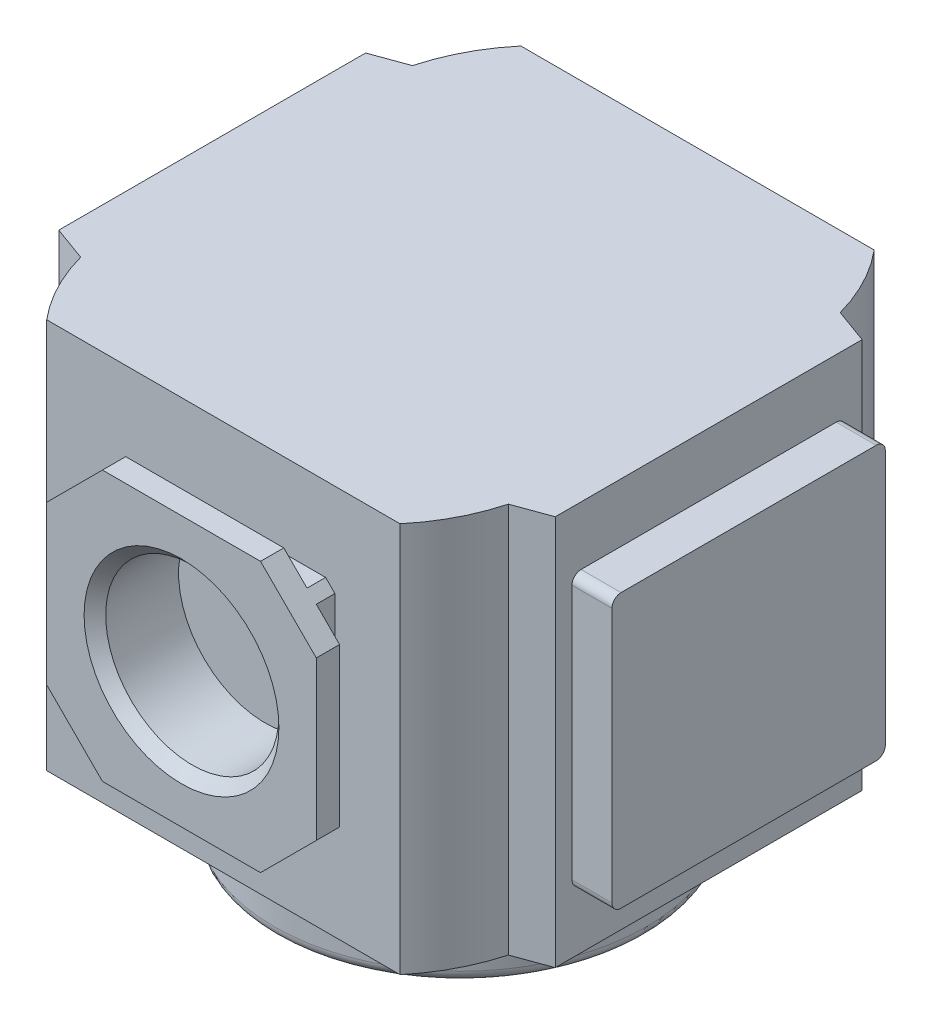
ISO-10303-21;
HEADER;
FILE_DESCRIPTION(('STEP AP214'),'2;1');
FILE_NAME('part.step','',(''),(''),'','','');
FILE_SCHEMA(('AUTOMOTIVE_DESIGN { 1 0 10303 214 1 1 1 1 }'));
ENDSEC;
DATA;
#1=APPLICATION_CONTEXT('core data for automotive mechanical design processes');
#2=APPLICATION_PROTOCOL_DEFINITION('international standard','automotive_design',2000,#1);
#3=PRODUCT_CONTEXT('',#1,'mechanical');
#4=PRODUCT('Part','Part','',(#3));
#5=PRODUCT_RELATED_PRODUCT_CATEGORY('part','',(#4));
#6=PRODUCT_DEFINITION_FORMATION('','',#4);
#7=PRODUCT_DEFINITION_CONTEXT('part definition',#1,'design');
#8=PRODUCT_DEFINITION('design','',#6,#7);
#9=PRODUCT_DEFINITION_SHAPE('','',#8);
#10=(LENGTH_UNIT() NAMED_UNIT(*) SI_UNIT(.MILLI.,.METRE.));
#11=(NAMED_UNIT(*) PLANE_ANGLE_UNIT() SI_UNIT($,.RADIAN.));
#12=(NAMED_UNIT(*) SI_UNIT($,.STERADIAN.) SOLID_ANGLE_UNIT());
#13=UNCERTAINTY_MEASURE_WITH_UNIT(LENGTH_MEASURE(1.E-05),#10,'distance_accuracy_value','');
#14=(GEOMETRIC_REPRESENTATION_CONTEXT(3) GLOBAL_UNCERTAINTY_ASSIGNED_CONTEXT((#13)) GLOBAL_UNIT_ASSIGNED_CONTEXT((#10,
#11,#12)) REPRESENTATION_CONTEXT('',''));
#15=CARTESIAN_POINT('',(0.,0.,0.));
#16=DIRECTION('',(0.,0.,1.));
#17=DIRECTION('',(1.,0.,0.));
#18=AXIS2_PLACEMENT_3D('',#15,#16,#17);
#19=CARTESIAN_POINT('',(26.7,21.,16.5));
#20=DIRECTION('',(-1.,0.,0.));
#21=DIRECTION('',(0.,0.,1.));
#22=AXIS2_PLACEMENT_3D('',#19,#20,#21);
#23=PLANE('',#22);
#24=DIRECTION('',(0.,-1.,0.));
#25=VECTOR('',#24,1.);
#26=CARTESIAN_POINT('',(26.7,21.,16.5));
#27=LINE('',#26,#25);
#28=CARTESIAN_POINT('',(26.7,21.,16.5));
#29=VERTEX_POINT('',#28);
#30=CARTESIAN_POINT('',(26.7,-21.,16.5));
#31=VERTEX_POINT('',#30);
#32=EDGE_CURVE('E897',#29,#31,#27,.T.);
#33=ORIENTED_EDGE('',*,*,#32,.T.);
#34=DIRECTION('',(0.,0.,-1.));
#35=VECTOR('',#34,1.);
#36=CARTESIAN_POINT('',(26.7,-21.,16.5));
#37=LINE('',#36,#35);
#38=CARTESIAN_POINT('',(26.7,-21.,-16.5));
#39=VERTEX_POINT('',#38);
#40=EDGE_CURVE('E883',#31,#39,#37,.T.);
#41=ORIENTED_EDGE('',*,*,#40,.T.);
#42=DIRECTION('',(0.,-1.,0.));
#43=VECTOR('',#42,1.);
#44=CARTESIAN_POINT('',(26.7,21.,-16.5));
#45=LINE('',#44,#43);
#46=CARTESIAN_POINT('',(26.7,21.,-16.5));
#47=VERTEX_POINT('',#46);
#48=EDGE_CURVE('E895',#47,#39,#45,.T.);
#49=ORIENTED_EDGE('',*,*,#48,.F.);
#50=DIRECTION('',(0.,0.,-1.));
#51=VECTOR('',#50,1.);
#52=CARTESIAN_POINT('',(26.7,21.,16.5));
#53=LINE('',#52,#51);
#54=EDGE_CURVE('E890',#29,#47,#53,.T.);
#55=ORIENTED_EDGE('',*,*,#54,.F.);
#56=EDGE_LOOP('',(#33,#41,#49,#55));
#57=FACE_BOUND('',#56,.T.);
#58=CARTESIAN_POINT('',(26.7,-13.72,13.72));
#59=DIRECTION('',(1.,0.,0.));
#60=DIRECTION('',(0.,0.,-1.));
#61=AXIS2_PLACEMENT_3D('',#58,#59,#60);
#62=CIRCLE('',#61,0.979999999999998);
#63=CARTESIAN_POINT('',(26.7,-13.72,14.7));
#64=VERTEX_POINT('',#63);
#65=CARTESIAN_POINT('',(26.7,-14.7,13.72));
#66=VERTEX_POINT('',#65);
#67=EDGE_CURVE('E482',#64,#66,#62,.T.);
#68=ORIENTED_EDGE('',*,*,#67,.F.);
#69=DIRECTION('',(0.,-1.,0.));
#70=VECTOR('',#69,1.);
#71=CARTESIAN_POINT('',(26.7,13.72,14.7));
#72=LINE('',#71,#70);
#73=CARTESIAN_POINT('',(26.7,13.72,14.7));
#74=VERTEX_POINT('',#73);
#75=EDGE_CURVE('E479',#74,#64,#72,.T.);
#76=ORIENTED_EDGE('',*,*,#75,.F.);
#77=CARTESIAN_POINT('',(26.7,13.72,13.72));
#78=DIRECTION('',(1.,0.,0.));
#79=DIRECTION('',(0.,0.,-1.));
#80=AXIS2_PLACEMENT_3D('',#77,#78,#79);
#81=CIRCLE('',#80,0.979999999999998);
#82=CARTESIAN_POINT('',(26.7,14.7,13.72));
#83=VERTEX_POINT('',#82);
#84=EDGE_CURVE('E2119',#83,#74,#81,.T.);
#85=ORIENTED_EDGE('',*,*,#84,.F.);
#86=DIRECTION('',(0.,0.,1.));
#87=VECTOR('',#86,1.);
#88=CARTESIAN_POINT('',(26.7,14.7,-13.72));
#89=LINE('',#88,#87);
#90=CARTESIAN_POINT('',(26.7,14.7,-13.72));
#91=VERTEX_POINT('',#90);
#92=EDGE_CURVE('E2150',#91,#83,#89,.T.);
#93=ORIENTED_EDGE('',*,*,#92,.F.);
#94=CARTESIAN_POINT('',(26.7,13.72,-13.72));
#95=DIRECTION('',(1.,0.,0.));
#96=DIRECTION('',(0.,0.,-1.));
#97=AXIS2_PLACEMENT_3D('',#94,#95,#96);
#98=CIRCLE('',#97,0.980000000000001);
#99=CARTESIAN_POINT('',(26.7,13.72,-14.7));
#100=VERTEX_POINT('',#99);
#101=EDGE_CURVE('E2143',#100,#91,#98,.T.);
#102=ORIENTED_EDGE('',*,*,#101,.F.);
#103=DIRECTION('',(0.,1.,0.));
#104=VECTOR('',#103,1.);
#105=CARTESIAN_POINT('',(26.7,-13.72,-14.7));
#106=LINE('',#105,#104);
#107=CARTESIAN_POINT('',(26.7,-13.72,-14.7));
#108=VERTEX_POINT('',#107);
#109=EDGE_CURVE('E2140',#108,#100,#106,.T.);
#110=ORIENTED_EDGE('',*,*,#109,.F.);
#111=CARTESIAN_POINT('',(26.7,-13.72,-13.72));
#112=DIRECTION('',(1.,0.,0.));
#113=DIRECTION('',(0.,0.,-1.));
#114=AXIS2_PLACEMENT_3D('',#111,#112,#113);
#115=CIRCLE('',#114,0.980000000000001);
#116=CARTESIAN_POINT('',(26.7,-14.7,-13.72));
#117=VERTEX_POINT('',#116);
#118=EDGE_CURVE('E57',#117,#108,#115,.T.);
#119=ORIENTED_EDGE('',*,*,#118,.F.);
#120=DIRECTION('',(0.,0.,-1.));
#121=VECTOR('',#120,1.);
#122=CARTESIAN_POINT('',(26.7,-14.7,13.72));
#123=LINE('',#122,#121);
#124=EDGE_CURVE('E52',#66,#117,#123,.T.);
#125=ORIENTED_EDGE('',*,*,#124,.F.);
#126=EDGE_LOOP('',(#68,#76,#85,#93,#102,#110,#119,#125));
#127=FACE_BOUND('',#126,.T.);
#128=ADVANCED_FACE('F37',(#57,#127),#23,.F.);
#129=CARTESIAN_POINT('',(-25.7,-14.,14.));
#130=DIRECTION('',(1.,0.,0.));
#131=DIRECTION('',(0.,0.,-1.));
#132=AXIS2_PLACEMENT_3D('',#129,#130,#131);
#133=PLANE('',#132);
#134=CARTESIAN_POINT('',(-25.7,-14.,14.));
#135=DIRECTION('',(1.,0.,0.));
#136=DIRECTION('',(0.,0.,-1.));
#137=AXIS2_PLACEMENT_3D('',#134,#135,#136);
#138=CIRCLE('',#137,0.999999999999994);
#139=CARTESIAN_POINT('',(-25.7,-14.,15.));
#140=VERTEX_POINT('',#139);
#141=CARTESIAN_POINT('',(-25.7,-15.,14.));
#142=VERTEX_POINT('',#141);
#143=EDGE_CURVE('E546',#140,#142,#138,.T.);
#144=ORIENTED_EDGE('',*,*,#143,.F.);
#145=DIRECTION('',(0.,-1.,0.));
#146=VECTOR('',#145,1.);
#147=CARTESIAN_POINT('',(-25.7,14.,15.));
#148=LINE('',#147,#146);
#149=CARTESIAN_POINT('',(-25.7,14.,15.));
#150=VERTEX_POINT('',#149);
#151=EDGE_CURVE('E562',#150,#140,#148,.T.);
#152=ORIENTED_EDGE('',*,*,#151,.F.);
#153=CARTESIAN_POINT('',(-25.7,14.,14.));
#154=DIRECTION('',(1.,0.,0.));
#155=DIRECTION('',(0.,0.,-1.));
#156=AXIS2_PLACEMENT_3D('',#153,#154,#155);
#157=CIRCLE('',#156,0.999999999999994);
#158=CARTESIAN_POINT('',(-25.7,15.,14.));
#159=VERTEX_POINT('',#158);
#160=EDGE_CURVE('E560',#159,#150,#157,.T.);
#161=ORIENTED_EDGE('',*,*,#160,.F.);
#162=DIRECTION('',(0.,0.,1.));
#163=VECTOR('',#162,1.);
#164=CARTESIAN_POINT('',(-25.7,15.,-14.));
#165=LINE('',#164,#163);
#166=CARTESIAN_POINT('',(-25.7,15.,-14.));
#167=VERTEX_POINT('',#166);
#168=EDGE_CURVE('E558',#167,#159,#165,.T.);
#169=ORIENTED_EDGE('',*,*,#168,.F.);
#170=CARTESIAN_POINT('',(-25.7,14.,-14.));
#171=DIRECTION('',(1.,0.,0.));
#172=DIRECTION('',(0.,0.,-1.));
#173=AXIS2_PLACEMENT_3D('',#170,#171,#172);
#174=CIRCLE('',#173,0.999999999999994);
#175=CARTESIAN_POINT('',(-25.7,14.,-15.));
#176=VERTEX_POINT('',#175);
#177=EDGE_CURVE('E556',#176,#167,#174,.T.);
#178=ORIENTED_EDGE('',*,*,#177,.F.);
#179=DIRECTION('',(0.,1.,0.));
#180=VECTOR('',#179,1.);
#181=CARTESIAN_POINT('',(-25.7,-14.,-15.));
#182=LINE('',#181,#180);
#183=CARTESIAN_POINT('',(-25.7,-14.,-15.));
#184=VERTEX_POINT('',#183);
#185=EDGE_CURVE('E554',#184,#176,#182,.T.);
#186=ORIENTED_EDGE('',*,*,#185,.F.);
#187=CARTESIAN_POINT('',(-25.7,-14.,-14.));
#188=DIRECTION('',(1.,0.,0.));
#189=DIRECTION('',(0.,0.,-1.));
#190=AXIS2_PLACEMENT_3D('',#187,#188,#189);
#191=CIRCLE('',#190,0.999999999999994);
#192=CARTESIAN_POINT('',(-25.7,-15.,-14.));
#193=VERTEX_POINT('',#192);
#194=EDGE_CURVE('E552',#193,#184,#191,.T.);
#195=ORIENTED_EDGE('',*,*,#194,.F.);
#196=DIRECTION('',(0.,0.,-1.));
#197=VECTOR('',#196,1.);
#198=CARTESIAN_POINT('',(-25.7,-15.,14.));
#199=LINE('',#198,#197);
#200=EDGE_CURVE('E549',#142,#193,#199,.T.);
#201=ORIENTED_EDGE('',*,*,#200,.F.);
#202=EDGE_LOOP('',(#144,#152,#161,#169,#178,#186,#195,#201));
#203=FACE_BOUND('',#202,.T.);
#204=CARTESIAN_POINT('',(-25.7,-13.72,13.72));
#205=DIRECTION('',(1.,0.,0.));
#206=DIRECTION('',(0.,0.,-1.));
#207=AXIS2_PLACEMENT_3D('',#204,#205,#206);
#208=CIRCLE('',#207,0.979999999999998);
#209=CARTESIAN_POINT('',(-25.7,-13.72,14.7));
#210=VERTEX_POINT('',#209);
#211=CARTESIAN_POINT('',(-25.7,-14.7,13.72));
#212=VERTEX_POINT('',#211);
#213=EDGE_CURVE('E492',#210,#212,#208,.T.);
#214=ORIENTED_EDGE('',*,*,#213,.T.);
#215=DIRECTION('',(0.,0.,-1.));
#216=VECTOR('',#215,1.);
#217=CARTESIAN_POINT('',(-25.7,-14.7,13.72));
#218=LINE('',#217,#216);
#219=CARTESIAN_POINT('',(-25.7,-14.7,-13.72));
#220=VERTEX_POINT('',#219);
#221=EDGE_CURVE('E494',#212,#220,#218,.T.);
#222=ORIENTED_EDGE('',*,*,#221,.T.);
#223=CARTESIAN_POINT('',(-25.7,-13.72,-13.72));
#224=DIRECTION('',(1.,0.,0.));
#225=DIRECTION('',(0.,0.,-1.));
#226=AXIS2_PLACEMENT_3D('',#223,#224,#225);
#227=CIRCLE('',#226,0.980000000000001);
#228=CARTESIAN_POINT('',(-25.7,-13.72,-14.7));
#229=VERTEX_POINT('',#228);
#230=EDGE_CURVE('E497',#220,#229,#227,.T.);
#231=ORIENTED_EDGE('',*,*,#230,.T.);
#232=DIRECTION('',(0.,1.,0.));
#233=VECTOR('',#232,1.);
#234=CARTESIAN_POINT('',(-25.7,-13.72,-14.7));
#235=LINE('',#234,#233);
#236=CARTESIAN_POINT('',(-25.7,13.72,-14.7));
#237=VERTEX_POINT('',#236);
#238=EDGE_CURVE('E499',#229,#237,#235,.T.);
#239=ORIENTED_EDGE('',*,*,#238,.T.);
#240=CARTESIAN_POINT('',(-25.7,13.72,-13.72));
#241=DIRECTION('',(1.,0.,0.));
#242=DIRECTION('',(0.,0.,-1.));
#243=AXIS2_PLACEMENT_3D('',#240,#241,#242);
#244=CIRCLE('',#243,0.980000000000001);
#245=CARTESIAN_POINT('',(-25.7,14.7,-13.72));
#246=VERTEX_POINT('',#245);
#247=EDGE_CURVE('E501',#237,#246,#244,.T.);
#248=ORIENTED_EDGE('',*,*,#247,.T.);
#249=DIRECTION('',(0.,0.,1.));
#250=VECTOR('',#249,1.);
#251=CARTESIAN_POINT('',(-25.7,14.7,-13.72));
#252=LINE('',#251,#250);
#253=CARTESIAN_POINT('',(-25.7,14.7,13.72));
#254=VERTEX_POINT('',#253);
#255=EDGE_CURVE('E503',#246,#254,#252,.T.);
#256=ORIENTED_EDGE('',*,*,#255,.T.);
#257=CARTESIAN_POINT('',(-25.7,13.72,13.72));
#258=DIRECTION('',(1.,0.,0.));
#259=DIRECTION('',(0.,0.,-1.));
#260=AXIS2_PLACEMENT_3D('',#257,#258,#259);
#261=CIRCLE('',#260,0.979999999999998);
#262=CARTESIAN_POINT('',(-25.7,13.72,14.7));
#263=VERTEX_POINT('',#262);
#264=EDGE_CURVE('E505',#254,#263,#261,.T.);
#265=ORIENTED_EDGE('',*,*,#264,.T.);
#266=DIRECTION('',(0.,-1.,0.));
#267=VECTOR('',#266,1.);
#268=CARTESIAN_POINT('',(-25.7,13.72,14.7));
#269=LINE('',#268,#267);
#270=EDGE_CURVE('E507',#263,#210,#269,.T.);
#271=ORIENTED_EDGE('',*,*,#270,.T.);
#272=EDGE_LOOP('',(#214,#222,#231,#239,#248,#256,#265,#271));
#273=FACE_BOUND('',#272,.T.);
#274=ADVANCED_FACE('F1033',(#203,#273),#133,.F.);
#275=CARTESIAN_POINT('',(-26.7,21.,-16.5));
#276=DIRECTION('',(1.,0.,0.));
#277=DIRECTION('',(0.,0.,-1.));
#278=AXIS2_PLACEMENT_3D('',#275,#276,#277);
#279=PLANE('',#278);
#280=DIRECTION('',(0.,-1.,0.));
#281=VECTOR('',#280,1.);
#282=CARTESIAN_POINT('',(-26.7,21.,-16.5));
#283=LINE('',#282,#281);
#284=CARTESIAN_POINT('',(-26.7,21.,-16.5));
#285=VERTEX_POINT('',#284);
#286=CARTESIAN_POINT('',(-26.7,-21.,-16.5));
#287=VERTEX_POINT('',#286);
#288=EDGE_CURVE('E917',#285,#287,#283,.T.);
#289=ORIENTED_EDGE('',*,*,#288,.T.);
#290=DIRECTION('',(0.,0.,1.));
#291=VECTOR('',#290,1.);
#292=CARTESIAN_POINT('',(-26.7,-21.,-16.5));
#293=LINE('',#292,#291);
#294=CARTESIAN_POINT('',(-26.7,-21.,16.5));
#295=VERTEX_POINT('',#294);
#296=EDGE_CURVE('E902',#287,#295,#293,.T.);
#297=ORIENTED_EDGE('',*,*,#296,.T.);
#298=DIRECTION('',(0.,-1.,0.));
#299=VECTOR('',#298,1.);
#300=CARTESIAN_POINT('',(-26.7,21.,16.5));
#301=LINE('',#300,#299);
#302=CARTESIAN_POINT('',(-26.7,21.,16.5));
#303=VERTEX_POINT('',#302);
#304=EDGE_CURVE('E915',#303,#295,#301,.T.);
#305=ORIENTED_EDGE('',*,*,#304,.F.);
#306=DIRECTION('',(0.,0.,1.));
#307=VECTOR('',#306,1.);
#308=CARTESIAN_POINT('',(-26.7,21.,-16.5));
#309=LINE('',#308,#307);
#310=EDGE_CURVE('E910',#285,#303,#309,.T.);
#311=ORIENTED_EDGE('',*,*,#310,.F.);
#312=EDGE_LOOP('',(#289,#297,#305,#311));
#313=FACE_BOUND('',#312,.T.);
#314=CARTESIAN_POINT('',(-26.7,-14.,14.));
#315=DIRECTION('',(1.,0.,0.));
#316=DIRECTION('',(0.,0.,-1.));
#317=AXIS2_PLACEMENT_3D('',#314,#315,#316);
#318=CIRCLE('',#317,0.999999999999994);
#319=CARTESIAN_POINT('',(-26.7,-14.,15.));
#320=VERTEX_POINT('',#319);
#321=CARTESIAN_POINT('',(-26.7,-15.,14.));
#322=VERTEX_POINT('',#321);
#323=EDGE_CURVE('E545',#320,#322,#318,.T.);
#324=ORIENTED_EDGE('',*,*,#323,.T.);
#325=DIRECTION('',(0.,0.,-1.));
#326=VECTOR('',#325,1.);
#327=CARTESIAN_POINT('',(-26.7,-15.,14.));
#328=LINE('',#327,#326);
#329=CARTESIAN_POINT('',(-26.7,-15.,-14.));
#330=VERTEX_POINT('',#329);
#331=EDGE_CURVE('E567',#322,#330,#328,.T.);
#332=ORIENTED_EDGE('',*,*,#331,.T.);
#333=CARTESIAN_POINT('',(-26.7,-14.,-14.));
#334=DIRECTION('',(1.,0.,0.));
#335=DIRECTION('',(0.,0.,-1.));
#336=AXIS2_PLACEMENT_3D('',#333,#334,#335);
#337=CIRCLE('',#336,0.999999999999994);
#338=CARTESIAN_POINT('',(-26.7,-14.,-15.));
#339=VERTEX_POINT('',#338);
#340=EDGE_CURVE('E570',#330,#339,#337,.T.);
#341=ORIENTED_EDGE('',*,*,#340,.T.);
#342=DIRECTION('',(0.,1.,0.));
#343=VECTOR('',#342,1.);
#344=CARTESIAN_POINT('',(-26.7,-14.,-15.));
#345=LINE('',#344,#343);
#346=CARTESIAN_POINT('',(-26.7,14.,-15.));
#347=VERTEX_POINT('',#346);
#348=EDGE_CURVE('E573',#339,#347,#345,.T.);
#349=ORIENTED_EDGE('',*,*,#348,.T.);
#350=CARTESIAN_POINT('',(-26.7,14.,-14.));
#351=DIRECTION('',(1.,0.,0.));
#352=DIRECTION('',(0.,0.,-1.));
#353=AXIS2_PLACEMENT_3D('',#350,#351,#352);
#354=CIRCLE('',#353,0.999999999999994);
#355=CARTESIAN_POINT('',(-26.7,15.,-14.));
#356=VERTEX_POINT('',#355);
#357=EDGE_CURVE('E576',#347,#356,#354,.T.);
#358=ORIENTED_EDGE('',*,*,#357,.T.);
#359=DIRECTION('',(0.,0.,1.));
#360=VECTOR('',#359,1.);
#361=CARTESIAN_POINT('',(-26.7,15.,-14.));
#362=LINE('',#361,#360);
#363=CARTESIAN_POINT('',(-26.7,15.,14.));
#364=VERTEX_POINT('',#363);
#365=EDGE_CURVE('E579',#356,#364,#362,.T.);
#366=ORIENTED_EDGE('',*,*,#365,.T.);
#367=CARTESIAN_POINT('',(-26.7,14.,14.));
#368=DIRECTION('',(1.,0.,0.));
#369=DIRECTION('',(0.,0.,-1.));
#370=AXIS2_PLACEMENT_3D('',#367,#368,#369);
#371=CIRCLE('',#370,0.999999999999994);
#372=CARTESIAN_POINT('',(-26.7,14.,15.));
#373=VERTEX_POINT('',#372);
#374=EDGE_CURVE('E582',#364,#373,#371,.T.);
#375=ORIENTED_EDGE('',*,*,#374,.T.);
#376=DIRECTION('',(0.,-1.,0.));
#377=VECTOR('',#376,1.);
#378=CARTESIAN_POINT('',(-26.7,14.,15.));
#379=LINE('',#378,#377);
#380=EDGE_CURVE('E550',#373,#320,#379,.T.);
#381=ORIENTED_EDGE('',*,*,#380,.T.);
#382=EDGE_LOOP('',(#324,#332,#341,#349,#358,#366,#375,#381));
#383=FACE_BOUND('',#382,.T.);
#384=ADVANCED_FACE('F989',(#313,#383),#279,.F.);
#385=CARTESIAN_POINT('',(-19.,21.,25.5));
#386=DIRECTION('',(0.,0.,-1.));
#387=DIRECTION('',(-1.,0.,0.));
#388=AXIS2_PLACEMENT_3D('',#385,#386,#387);
#389=PLANE('',#388);
#390=DIRECTION('',(0.,-1.,0.));
#391=VECTOR('',#390,1.);
#392=CARTESIAN_POINT('',(-19.,21.,25.5));
#393=LINE('',#392,#391);
#394=CARTESIAN_POINT('',(-19.,21.,25.5));
#395=VERTEX_POINT('',#394);
#396=CARTESIAN_POINT('',(-19.,-21.,25.5));
#397=VERTEX_POINT('',#396);
#398=EDGE_CURVE('E45',#395,#397,#393,.T.);
#399=ORIENTED_EDGE('',*,*,#398,.T.);
#400=DIRECTION('',(1.,0.,0.));
#401=VECTOR('',#400,1.);
#402=CARTESIAN_POINT('',(-19.,-21.,25.5));
#403=LINE('',#402,#401);
#404=CARTESIAN_POINT('',(19.,-21.,25.5));
#405=VERTEX_POINT('',#404);
#406=EDGE_CURVE('E922',#397,#405,#403,.T.);
#407=ORIENTED_EDGE('',*,*,#406,.T.);
#408=DIRECTION('',(0.,-1.,0.));
#409=VECTOR('',#408,1.);
#410=CARTESIAN_POINT('',(19.,21.,25.5));
#411=LINE('',#410,#409);
#412=CARTESIAN_POINT('',(19.,21.,25.5));
#413=VERTEX_POINT('',#412);
#414=EDGE_CURVE('E966',#413,#405,#411,.T.);
#415=ORIENTED_EDGE('',*,*,#414,.F.);
#416=DIRECTION('',(1.,0.,0.));
#417=VECTOR('',#416,1.);
#418=CARTESIAN_POINT('',(-19.,21.,25.5));
#419=LINE('',#418,#417);
#420=EDGE_CURVE('E940',#395,#413,#419,.T.);
#421=ORIENTED_EDGE('',*,*,#420,.F.);
#422=EDGE_LOOP('',(#399,#407,#415,#421));
#423=FACE_BOUND('',#422,.T.);
#424=DIRECTION('',(-0.707106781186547,-0.707106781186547,0.));
#425=VECTOR('',#424,1.);
#426=CARTESIAN_POINT('',(-11.,12.,25.5));
#427=LINE('',#426,#425);
#428=CARTESIAN_POINT('',(-11.,12.,25.5));
#429=VERTEX_POINT('',#428);
#430=CARTESIAN_POINT('',(-12.,11.,25.5));
#431=VERTEX_POINT('',#430);
#432=EDGE_CURVE('E808',#429,#431,#427,.T.);
#433=ORIENTED_EDGE('',*,*,#432,.F.);
#434=DIRECTION('',(-1.,0.,0.));
#435=VECTOR('',#434,1.);
#436=CARTESIAN_POINT('',(11.,12.,25.5));
#437=LINE('',#436,#435);
#438=CARTESIAN_POINT('',(11.,12.,25.5));
#439=VERTEX_POINT('',#438);
#440=EDGE_CURVE('E813',#439,#429,#437,.T.);
#441=ORIENTED_EDGE('',*,*,#440,.F.);
#442=DIRECTION('',(-0.707106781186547,0.707106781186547,0.));
#443=VECTOR('',#442,1.);
#444=CARTESIAN_POINT('',(12.,11.,25.5));
#445=LINE('',#444,#443);
#446=CARTESIAN_POINT('',(12.,11.,25.5));
#447=VERTEX_POINT('',#446);
#448=EDGE_CURVE('E840',#447,#439,#445,.T.);
#449=ORIENTED_EDGE('',*,*,#448,.F.);
#450=DIRECTION('',(0.,1.,0.));
#451=VECTOR('',#450,1.);
#452=CARTESIAN_POINT('',(12.,-11.,25.5));
#453=LINE('',#452,#451);
#454=CARTESIAN_POINT('',(12.,-11.,25.5));
#455=VERTEX_POINT('',#454);
#456=EDGE_CURVE('E837',#455,#447,#453,.T.);
#457=ORIENTED_EDGE('',*,*,#456,.F.);
#458=DIRECTION('',(0.707106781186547,0.707106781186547,0.));
#459=VECTOR('',#458,1.);
#460=CARTESIAN_POINT('',(11.,-12.,25.5));
#461=LINE('',#460,#459);
#462=CARTESIAN_POINT('',(11.,-12.,25.5));
#463=VERTEX_POINT('',#462);
#464=EDGE_CURVE('E834',#463,#455,#461,.T.);
#465=ORIENTED_EDGE('',*,*,#464,.F.);
#466=DIRECTION('',(1.,0.,0.));
#467=VECTOR('',#466,1.);
#468=CARTESIAN_POINT('',(-11.,-12.,25.5));
#469=LINE('',#468,#467);
#470=CARTESIAN_POINT('',(-11.,-12.,25.5));
#471=VERTEX_POINT('',#470);
#472=EDGE_CURVE('E831',#471,#463,#469,.T.);
#473=ORIENTED_EDGE('',*,*,#472,.F.);
#474=DIRECTION('',(0.707106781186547,-0.707106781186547,0.));
#475=VECTOR('',#474,1.);
#476=CARTESIAN_POINT('',(-12.,-11.,25.5));
#477=LINE('',#476,#475);
#478=CARTESIAN_POINT('',(-12.,-11.,25.5));
#479=VERTEX_POINT('',#478);
#480=EDGE_CURVE('E828',#479,#471,#477,.T.);
#481=ORIENTED_EDGE('',*,*,#480,.F.);
#482=DIRECTION('',(0.,-1.,0.));
#483=VECTOR('',#482,1.);
#484=CARTESIAN_POINT('',(-12.,11.,25.5));
#485=LINE('',#484,#483);
#486=EDGE_CURVE('E825',#431,#479,#485,.T.);
#487=ORIENTED_EDGE('',*,*,#486,.F.);
#488=EDGE_LOOP('',(#433,#441,#449,#457,#465,#473,#481,#487));
#489=FACE_BOUND('',#488,.T.);
#490=ADVANCED_FACE('F970',(#423,#489),#389,.F.);
#491=CARTESIAN_POINT('',(-3.69292213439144,21.,12.6278064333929));
#492=DIRECTION('',(0.,-1.,0.));
#493=DIRECTION('',(0.,0.,-1.));
#494=AXIS2_PLACEMENT_3D('',#491,#492,#493);
#495=CYLINDRICAL_SURFACE('',#494,20.0000000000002);
#496=DIRECTION('',(0.,-1.,0.));
#497=VECTOR('',#496,1.);
#498=CARTESIAN_POINT('',(-23.,21.,17.846689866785));
#499=LINE('',#498,#497);
#500=CARTESIAN_POINT('',(-23.,21.,17.846689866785));
#501=VERTEX_POINT('',#500);
#502=CARTESIAN_POINT('',(-23.,-21.,17.8466898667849));
#503=VERTEX_POINT('',#502);
#504=EDGE_CURVE('E952',#501,#503,#499,.T.);
#505=ORIENTED_EDGE('',*,*,#504,.T.);
#506=CARTESIAN_POINT('',(-3.69292213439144,-21.,12.6278064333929));
#507=DIRECTION('',(0.,1.,0.));
#508=DIRECTION('',(0.,0.,1.));
#509=AXIS2_PLACEMENT_3D('',#506,#507,#508);
#510=CIRCLE('',#509,20.0000000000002);
#511=EDGE_CURVE('E919',#503,#397,#510,.T.);
#512=ORIENTED_EDGE('',*,*,#511,.T.);
#513=ORIENTED_EDGE('',*,*,#398,.F.);
#514=CARTESIAN_POINT('',(-3.69292213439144,21.,12.6278064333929));
#515=DIRECTION('',(0.,1.,0.));
#516=DIRECTION('',(0.,0.,1.));
#517=AXIS2_PLACEMENT_3D('',#514,#515,#516);
#518=CIRCLE('',#517,20.0000000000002);
#519=EDGE_CURVE('E937',#501,#395,#518,.T.);
#520=ORIENTED_EDGE('',*,*,#519,.F.);
#521=EDGE_LOOP('',(#505,#512,#513,#520));
#522=FACE_BOUND('',#521,.T.);
#523=ADVANCED_FACE('F39',(#522),#495,.T.);
#524=CARTESIAN_POINT('',(3.69292213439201,21.,12.6278064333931));
#525=DIRECTION('',(0.,-1.,0.));
#526=DIRECTION('',(0.,0.,-1.));
#527=AXIS2_PLACEMENT_3D('',#524,#525,#526);
#528=CYLINDRICAL_SURFACE('',#527,19.9999999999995);
#529=ORIENTED_EDGE('',*,*,#414,.T.);
#530=CARTESIAN_POINT('',(3.69292213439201,-21.,12.6278064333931));
#531=DIRECTION('',(0.,1.,0.));
#532=DIRECTION('',(0.,0.,1.));
#533=AXIS2_PLACEMENT_3D('',#530,#531,#532);
#534=CIRCLE('',#533,19.9999999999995);
#535=CARTESIAN_POINT('',(23.,-21.,17.8466898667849));
#536=VERTEX_POINT('',#535);
#537=EDGE_CURVE('E925',#405,#536,#534,.T.);
#538=ORIENTED_EDGE('',*,*,#537,.T.);
#539=DIRECTION('',(0.,-1.,0.));
#540=VECTOR('',#539,1.);
#541=CARTESIAN_POINT('',(23.,21.,17.8466898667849));
#542=LINE('',#541,#540);
#543=CARTESIAN_POINT('',(23.,21.,17.8466898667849));
#544=VERTEX_POINT('',#543);
#545=EDGE_CURVE('E964',#544,#536,#542,.T.);
#546=ORIENTED_EDGE('',*,*,#545,.F.);
#547=CARTESIAN_POINT('',(3.69292213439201,21.,12.6278064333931));
#548=DIRECTION('',(0.,1.,0.));
#549=DIRECTION('',(0.,0.,1.));
#550=AXIS2_PLACEMENT_3D('',#547,#548,#549);
#551=CIRCLE('',#550,19.9999999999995);
#552=EDGE_CURVE('E942',#413,#544,#551,.T.);
#553=ORIENTED_EDGE('',*,*,#552,.F.);
#554=EDGE_LOOP('',(#529,#538,#546,#553));
#555=FACE_BOUND('',#554,.T.);
#556=ADVANCED_FACE('F1023',(#555),#528,.T.);
#557=CARTESIAN_POINT('',(3.69292213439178,21.,-12.627806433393));
#558=DIRECTION('',(0.,-1.,0.));
#559=DIRECTION('',(0.,0.,-1.));
#560=AXIS2_PLACEMENT_3D('',#557,#558,#559);
#561=CYLINDRICAL_SURFACE('',#560,19.9999999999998);
#562=DIRECTION('',(0.,-1.,0.));
#563=VECTOR('',#562,1.);
#564=CARTESIAN_POINT('',(23.,21.,-17.8466898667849));
#565=LINE('',#564,#563);
#566=CARTESIAN_POINT('',(23.,21.,-17.8466898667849));
#567=VERTEX_POINT('',#566);
#568=CARTESIAN_POINT('',(23.,-21.,-17.8466898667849));
#569=VERTEX_POINT('',#568);
#570=EDGE_CURVE('E961',#567,#569,#565,.T.);
#571=ORIENTED_EDGE('',*,*,#570,.T.);
#572=CARTESIAN_POINT('',(3.69292213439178,-21.,-12.627806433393));
#573=DIRECTION('',(0.,1.,0.));
#574=DIRECTION('',(0.,0.,1.));
#575=AXIS2_PLACEMENT_3D('',#572,#573,#574);
#576=CIRCLE('',#575,19.9999999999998);
#577=CARTESIAN_POINT('',(19.,-21.,-25.5));
#578=VERTEX_POINT('',#577);
#579=EDGE_CURVE('E928',#569,#578,#576,.T.);
#580=ORIENTED_EDGE('',*,*,#579,.T.);
#581=DIRECTION('',(0.,-1.,0.));
#582=VECTOR('',#581,1.);
#583=CARTESIAN_POINT('',(19.,21.,-25.5));
#584=LINE('',#583,#582);
#585=CARTESIAN_POINT('',(19.,21.,-25.5));
#586=VERTEX_POINT('',#585);
#587=EDGE_CURVE('E959',#586,#578,#584,.T.);
#588=ORIENTED_EDGE('',*,*,#587,.F.);
#589=CARTESIAN_POINT('',(3.69292213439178,21.,-12.627806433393));
#590=DIRECTION('',(0.,1.,0.));
#591=DIRECTION('',(0.,0.,1.));
#592=AXIS2_PLACEMENT_3D('',#589,#590,#591);
#593=CIRCLE('',#592,19.9999999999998);
#594=EDGE_CURVE('E945',#567,#586,#593,.T.);
#595=ORIENTED_EDGE('',*,*,#594,.F.);
#596=EDGE_LOOP('',(#571,#580,#588,#595));
#597=FACE_BOUND('',#596,.T.);
#598=ADVANCED_FACE('F1009',(#597),#561,.T.);
#599=CARTESIAN_POINT('',(19.,21.,-25.5));
#600=DIRECTION('',(0.,0.,1.));
#601=DIRECTION('',(1.,0.,0.));
#602=AXIS2_PLACEMENT_3D('',#599,#600,#601);
#603=PLANE('',#602);
#604=DIRECTION('',(-1.,0.,0.));
#605=VECTOR('',#604,1.);
#606=CARTESIAN_POINT('',(11.,12.,-25.5));
#607=LINE('',#606,#605);
#608=CARTESIAN_POINT('',(11.,12.,-25.5));
#609=VERTEX_POINT('',#608);
#610=CARTESIAN_POINT('',(-11.,12.,-25.5));
#611=VERTEX_POINT('',#610);
#612=EDGE_CURVE('E695',#609,#611,#607,.T.);
#613=ORIENTED_EDGE('',*,*,#612,.T.);
#614=DIRECTION('',(-0.707106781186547,-0.707106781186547,0.));
#615=VECTOR('',#614,1.);
#616=CARTESIAN_POINT('',(-11.,12.,-25.5));
#617=LINE('',#616,#615);
#618=CARTESIAN_POINT('',(-12.,11.,-25.5));
#619=VERTEX_POINT('',#618);
#620=EDGE_CURVE('E673',#611,#619,#617,.T.);
#621=ORIENTED_EDGE('',*,*,#620,.T.);
#622=DIRECTION('',(0.,-1.,0.));
#623=VECTOR('',#622,1.);
#624=CARTESIAN_POINT('',(-12.,11.,-25.5));
#625=LINE('',#624,#623);
#626=CARTESIAN_POINT('',(-12.,-11.,-25.5));
#627=VERTEX_POINT('',#626);
#628=EDGE_CURVE('E707',#619,#627,#625,.T.);
#629=ORIENTED_EDGE('',*,*,#628,.T.);
#630=DIRECTION('',(0.707106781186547,-0.707106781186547,0.));
#631=VECTOR('',#630,1.);
#632=CARTESIAN_POINT('',(-12.,-11.,-25.5));
#633=LINE('',#632,#631);
#634=CARTESIAN_POINT('',(-11.,-12.,-25.5));
#635=VERTEX_POINT('',#634);
#636=EDGE_CURVE('E710',#627,#635,#633,.T.);
#637=ORIENTED_EDGE('',*,*,#636,.T.);
#638=DIRECTION('',(1.,0.,0.));
#639=VECTOR('',#638,1.);
#640=CARTESIAN_POINT('',(-11.,-12.,-25.5));
#641=LINE('',#640,#639);
#642=CARTESIAN_POINT('',(11.,-12.,-25.5));
#643=VERTEX_POINT('',#642);
#644=EDGE_CURVE('E713',#635,#643,#641,.T.);
#645=ORIENTED_EDGE('',*,*,#644,.T.);
#646=DIRECTION('',(0.707106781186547,0.707106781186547,0.));
#647=VECTOR('',#646,1.);
#648=CARTESIAN_POINT('',(11.,-12.,-25.5));
#649=LINE('',#648,#647);
#650=CARTESIAN_POINT('',(12.,-11.,-25.5));
#651=VERTEX_POINT('',#650);
#652=EDGE_CURVE('E716',#643,#651,#649,.T.);
#653=ORIENTED_EDGE('',*,*,#652,.T.);
#654=DIRECTION('',(0.,1.,0.));
#655=VECTOR('',#654,1.);
#656=CARTESIAN_POINT('',(12.,-11.,-25.5));
#657=LINE('',#656,#655);
#658=CARTESIAN_POINT('',(12.,11.,-25.5));
#659=VERTEX_POINT('',#658);
#660=EDGE_CURVE('E719',#651,#659,#657,.T.);
#661=ORIENTED_EDGE('',*,*,#660,.T.);
#662=DIRECTION('',(-0.707106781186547,0.707106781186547,0.));
#663=VECTOR('',#662,1.);
#664=CARTESIAN_POINT('',(12.,11.,-25.5));
#665=LINE('',#664,#663);
#666=EDGE_CURVE('E722',#659,#609,#665,.T.);
#667=ORIENTED_EDGE('',*,*,#666,.T.);
#668=EDGE_LOOP('',(#613,#621,#629,#637,#645,#653,#661,#667));
#669=FACE_BOUND('',#668,.T.);
#670=ORIENTED_EDGE('',*,*,#587,.T.);
#671=DIRECTION('',(-1.,0.,0.));
#672=VECTOR('',#671,1.);
#673=CARTESIAN_POINT('',(19.,-21.,-25.5));
#674=LINE('',#673,#672);
#675=CARTESIAN_POINT('',(-19.,-21.,-25.5));
#676=VERTEX_POINT('',#675);
#677=EDGE_CURVE('E931',#578,#676,#674,.T.);
#678=ORIENTED_EDGE('',*,*,#677,.T.);
#679=DIRECTION('',(0.,-1.,0.));
#680=VECTOR('',#679,1.);
#681=CARTESIAN_POINT('',(-19.,21.,-25.5));
#682=LINE('',#681,#680);
#683=CARTESIAN_POINT('',(-19.,21.,-25.5));
#684=VERTEX_POINT('',#683);
#685=EDGE_CURVE('E957',#684,#676,#682,.T.);
#686=ORIENTED_EDGE('',*,*,#685,.F.);
#687=DIRECTION('',(-1.,0.,0.));
#688=VECTOR('',#687,1.);
#689=CARTESIAN_POINT('',(19.,21.,-25.5));
#690=LINE('',#689,#688);
#691=EDGE_CURVE('E947',#586,#684,#690,.T.);
#692=ORIENTED_EDGE('',*,*,#691,.F.);
#693=EDGE_LOOP('',(#670,#678,#686,#692));
#694=FACE_BOUND('',#693,.T.);
#695=ADVANCED_FACE('F1004',(#669,#694),#603,.F.);
#696=CARTESIAN_POINT('',(-3.69292213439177,21.,-12.627806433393));
#697=DIRECTION('',(0.,-1.,0.));
#698=DIRECTION('',(0.,0.,-1.));
#699=AXIS2_PLACEMENT_3D('',#696,#697,#698);
#700=CYLINDRICAL_SURFACE('',#699,19.9999999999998);
#701=ORIENTED_EDGE('',*,*,#685,.T.);
#702=CARTESIAN_POINT('',(-3.69292213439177,-21.,-12.627806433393));
#703=DIRECTION('',(0.,1.,0.));
#704=DIRECTION('',(0.,0.,1.));
#705=AXIS2_PLACEMENT_3D('',#702,#703,#704);
#706=CIRCLE('',#705,19.9999999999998);
#707=CARTESIAN_POINT('',(-23.,-21.,-17.8466898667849));
#708=VERTEX_POINT('',#707);
#709=EDGE_CURVE('E934',#676,#708,#706,.T.);
#710=ORIENTED_EDGE('',*,*,#709,.T.);
#711=DIRECTION('',(0.,-1.,0.));
#712=VECTOR('',#711,1.);
#713=CARTESIAN_POINT('',(-23.,21.,-17.846689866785));
#714=LINE('',#713,#712);
#715=CARTESIAN_POINT('',(-23.,21.,-17.8466898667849));
#716=VERTEX_POINT('',#715);
#717=EDGE_CURVE('E955',#716,#708,#714,.T.);
#718=ORIENTED_EDGE('',*,*,#717,.F.);
#719=CARTESIAN_POINT('',(-3.69292213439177,21.,-12.627806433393));
#720=DIRECTION('',(0.,1.,0.));
#721=DIRECTION('',(0.,0.,1.));
#722=AXIS2_PLACEMENT_3D('',#719,#720,#721);
#723=CIRCLE('',#722,19.9999999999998);
#724=EDGE_CURVE('E949',#684,#716,#723,.T.);
#725=ORIENTED_EDGE('',*,*,#724,.F.);
#726=EDGE_LOOP('',(#701,#710,#718,#725));
#727=FACE_BOUND('',#726,.T.);
#728=ADVANCED_FACE('F999',(#727),#700,.T.);
#729=CARTESIAN_POINT('',(-3.69292213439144,21.,12.6278064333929));
#730=DIRECTION('',(0.,1.,0.));
#731=DIRECTION('',(0.,0.,1.));
#732=AXIS2_PLACEMENT_3D('',#729,#730,#731);
#733=PLANE('',#732);
#734=ORIENTED_EDGE('',*,*,#519,.T.);
#735=ORIENTED_EDGE('',*,*,#420,.T.);
#736=ORIENTED_EDGE('',*,*,#552,.T.);
#737=DIRECTION('',(0.939692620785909,0.,-0.342020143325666));
#738=VECTOR('',#737,1.);
#739=CARTESIAN_POINT('',(23.,21.,17.8466898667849));
#740=LINE('',#739,#738);
#741=EDGE_CURVE('E888',#544,#29,#740,.T.);
#742=ORIENTED_EDGE('',*,*,#741,.T.);
#743=ORIENTED_EDGE('',*,*,#54,.T.);
#744=DIRECTION('',(-0.939692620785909,0.,-0.342020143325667));
#745=VECTOR('',#744,1.);
#746=CARTESIAN_POINT('',(26.7,21.,-16.5));
#747=LINE('',#746,#745);
#748=EDGE_CURVE('E892',#47,#567,#747,.T.);
#749=ORIENTED_EDGE('',*,*,#748,.T.);
#750=ORIENTED_EDGE('',*,*,#594,.T.);
#751=ORIENTED_EDGE('',*,*,#691,.T.);
#752=ORIENTED_EDGE('',*,*,#724,.T.);
#753=DIRECTION('',(-0.939692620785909,0.,0.342020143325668));
#754=VECTOR('',#753,1.);
#755=CARTESIAN_POINT('',(-23.,21.,-17.8466898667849));
#756=LINE('',#755,#754);
#757=EDGE_CURVE('E907',#716,#285,#756,.T.);
#758=ORIENTED_EDGE('',*,*,#757,.T.);
#759=ORIENTED_EDGE('',*,*,#310,.T.);
#760=DIRECTION('',(0.93969262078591,0.,0.342020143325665));
#761=VECTOR('',#760,1.);
#762=CARTESIAN_POINT('',(-26.7,21.,16.5));
#763=LINE('',#762,#761);
#764=EDGE_CURVE('E912',#303,#501,#763,.T.);
#765=ORIENTED_EDGE('',*,*,#764,.T.);
#766=EDGE_LOOP('',(#734,#735,#736,#742,#743,#749,#750,#751,#752,#758,#759,#765));
#767=FACE_BOUND('',#766,.T.);
#768=ADVANCED_FACE('F985',(#767),#733,.T.);
#769=CARTESIAN_POINT('',(-3.69292213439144,-21.,12.6278064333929));
#770=DIRECTION('',(0.,1.,0.));
#771=DIRECTION('',(0.,0.,1.));
#772=AXIS2_PLACEMENT_3D('',#769,#770,#771);
#773=PLANE('',#772);
#774=CARTESIAN_POINT('',(0.,-21.,0.));
#775=DIRECTION('',(0.,1.,0.));
#776=DIRECTION('',(0.,0.,1.));
#777=AXIS2_PLACEMENT_3D('',#774,#775,#776);
#778=CIRCLE('',#777,20.1);
#779=CARTESIAN_POINT('',(0.,-21.,20.1));
#780=VERTEX_POINT('',#779);
#781=EDGE_CURVE('E11',#780,#780,#778,.F.);
#782=ORIENTED_EDGE('',*,*,#781,.F.);
#783=EDGE_LOOP('',(#782));
#784=FACE_BOUND('',#783,.T.);
#785=ORIENTED_EDGE('',*,*,#511,.F.);
#786=DIRECTION('',(0.93969262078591,0.,0.342020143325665));
#787=VECTOR('',#786,1.);
#788=CARTESIAN_POINT('',(-26.7,-21.,16.5));
#789=LINE('',#788,#787);
#790=EDGE_CURVE('E905',#295,#503,#789,.T.);
#791=ORIENTED_EDGE('',*,*,#790,.F.);
#792=ORIENTED_EDGE('',*,*,#296,.F.);
#793=DIRECTION('',(-0.939692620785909,0.,0.342020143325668));
#794=VECTOR('',#793,1.);
#795=CARTESIAN_POINT('',(-23.,-21.,-17.8466898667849));
#796=LINE('',#795,#794);
#797=EDGE_CURVE('E899',#708,#287,#796,.T.);
#798=ORIENTED_EDGE('',*,*,#797,.F.);
#799=ORIENTED_EDGE('',*,*,#709,.F.);
#800=ORIENTED_EDGE('',*,*,#677,.F.);
#801=ORIENTED_EDGE('',*,*,#579,.F.);
#802=DIRECTION('',(-0.939692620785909,0.,-0.342020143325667));
#803=VECTOR('',#802,1.);
#804=CARTESIAN_POINT('',(26.7,-21.,-16.5));
#805=LINE('',#804,#803);
#806=EDGE_CURVE('E886',#39,#569,#805,.T.);
#807=ORIENTED_EDGE('',*,*,#806,.F.);
#808=ORIENTED_EDGE('',*,*,#40,.F.);
#809=DIRECTION('',(0.939692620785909,0.,-0.342020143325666));
#810=VECTOR('',#809,1.);
#811=CARTESIAN_POINT('',(23.,-21.,17.8466898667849));
#812=LINE('',#811,#810);
#813=EDGE_CURVE('E880',#536,#31,#812,.T.);
#814=ORIENTED_EDGE('',*,*,#813,.F.);
#815=ORIENTED_EDGE('',*,*,#537,.F.);
#816=ORIENTED_EDGE('',*,*,#406,.F.);
#817=EDGE_LOOP('',(#785,#791,#792,#798,#799,#800,#801,#807,#808,#814,#815,#816));
#818=FACE_BOUND('',#817,.T.);
#819=ADVANCED_FACE('F978',(#784,#818),#773,.F.);
#820=CARTESIAN_POINT('',(-23.,21.,-17.8466898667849));
#821=DIRECTION('',(0.342020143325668,0.,0.939692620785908));
#822=DIRECTION('',(0.939692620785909,0.,-0.342020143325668));
#823=AXIS2_PLACEMENT_3D('',#820,#821,#822);
#824=PLANE('',#823);
#825=ORIENTED_EDGE('',*,*,#717,.T.);
#826=ORIENTED_EDGE('',*,*,#797,.T.);
#827=ORIENTED_EDGE('',*,*,#288,.F.);
#828=ORIENTED_EDGE('',*,*,#757,.F.);
#829=EDGE_LOOP('',(#825,#826,#827,#828));
#830=FACE_BOUND('',#829,.T.);
#831=ADVANCED_FACE('F995',(#830),#824,.F.);
#832=CARTESIAN_POINT('',(-26.7,21.,16.5));
#833=DIRECTION('',(0.342020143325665,0.,-0.93969262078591));
#834=DIRECTION('',(-0.93969262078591,0.,-0.342020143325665));
#835=AXIS2_PLACEMENT_3D('',#832,#833,#834);
#836=PLANE('',#835);
#837=ORIENTED_EDGE('',*,*,#304,.T.);
#838=ORIENTED_EDGE('',*,*,#790,.T.);
#839=ORIENTED_EDGE('',*,*,#504,.F.);
#840=ORIENTED_EDGE('',*,*,#764,.F.);
#841=EDGE_LOOP('',(#837,#838,#839,#840));
#842=FACE_BOUND('',#841,.T.);
#843=ADVANCED_FACE('F983',(#842),#836,.F.);
#844=CARTESIAN_POINT('',(23.,21.,17.8466898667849));
#845=DIRECTION('',(-0.342020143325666,0.,-0.939692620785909));
#846=DIRECTION('',(-0.939692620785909,0.,0.342020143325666));
#847=AXIS2_PLACEMENT_3D('',#844,#845,#846);
#848=PLANE('',#847);
#849=ORIENTED_EDGE('',*,*,#545,.T.);
#850=ORIENTED_EDGE('',*,*,#813,.T.);
#851=ORIENTED_EDGE('',*,*,#32,.F.);
#852=ORIENTED_EDGE('',*,*,#741,.F.);
#853=EDGE_LOOP('',(#849,#850,#851,#852));
#854=FACE_BOUND('',#853,.T.);
#855=ADVANCED_FACE('F1020',(#854),#848,.F.);
#856=CARTESIAN_POINT('',(26.7,21.,-16.5));
#857=DIRECTION('',(-0.342020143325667,0.,0.939692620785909));
#858=DIRECTION('',(0.939692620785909,0.,0.342020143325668));
#859=AXIS2_PLACEMENT_3D('',#856,#857,#858);
#860=PLANE('',#859);
#861=ORIENTED_EDGE('',*,*,#48,.T.);
#862=ORIENTED_EDGE('',*,*,#806,.T.);
#863=ORIENTED_EDGE('',*,*,#570,.F.);
#864=ORIENTED_EDGE('',*,*,#748,.F.);
#865=EDGE_LOOP('',(#861,#862,#863,#864));
#866=FACE_BOUND('',#865,.T.);
#867=ADVANCED_FACE('F1013',(#866),#860,.F.);
#868=CARTESIAN_POINT('',(0.,-30.,0.));
#869=DIRECTION('',(0.,1.,0.));
#870=DIRECTION('',(0.,0.,1.));
#871=AXIS2_PLACEMENT_3D('',#868,#869,#870);
#872=CYLINDRICAL_SURFACE('',#871,20.1);
#873=ORIENTED_EDGE('',*,*,#781,.T.);
#874=EDGE_LOOP('',(#873));
#875=FACE_BOUND('',#874,.T.);
#876=CARTESIAN_POINT('',(0.,-23.,0.));
#877=DIRECTION('',(0.,1.,0.));
#878=DIRECTION('',(0.,0.,1.));
#879=AXIS2_PLACEMENT_3D('',#876,#877,#878);
#880=CIRCLE('',#879,20.1);
#881=CARTESIAN_POINT('',(0.,-23.,20.1));
#882=VERTEX_POINT('',#881);
#883=EDGE_CURVE('E877',#882,#882,#880,.T.);
#884=ORIENTED_EDGE('',*,*,#883,.T.);
#885=EDGE_LOOP('',(#884));
#886=FACE_BOUND('',#885,.T.);
#887=ADVANCED_FACE('F1225',(#875,#886),#872,.T.);
#888=CARTESIAN_POINT('',(20.1,-23.,0.));
#889=DIRECTION('',(0.,1.,0.));
#890=DIRECTION('',(0.,0.,1.));
#891=AXIS2_PLACEMENT_3D('',#888,#889,#890);
#892=PLANE('',#891);
#893=ORIENTED_EDGE('',*,*,#883,.F.);
#894=EDGE_LOOP('',(#893));
#895=FACE_BOUND('',#894,.T.);
#896=CARTESIAN_POINT('',(0.,-23.,0.));
#897=DIRECTION('',(0.,1.,0.));
#898=DIRECTION('',(0.,0.,1.));
#899=AXIS2_PLACEMENT_3D('',#896,#897,#898);
#900=CIRCLE('',#899,20.);
#901=CARTESIAN_POINT('',(0.,-23.,20.));
#902=VERTEX_POINT('',#901);
#903=EDGE_CURVE('E874',#902,#902,#900,.T.);
#904=ORIENTED_EDGE('',*,*,#903,.T.);
#905=EDGE_LOOP('',(#904));
#906=FACE_BOUND('',#905,.T.);
#907=ADVANCED_FACE('F1222',(#895,#906),#892,.F.);
#908=CARTESIAN_POINT('',(0.,-30.,0.));
#909=DIRECTION('',(0.,1.,0.));
#910=DIRECTION('',(0.,0.,1.));
#911=AXIS2_PLACEMENT_3D('',#908,#909,#910);
#912=CYLINDRICAL_SURFACE('',#911,20.);
#913=ORIENTED_EDGE('',*,*,#903,.F.);
#914=EDGE_LOOP('',(#913));
#915=FACE_BOUND('',#914,.T.);
#916=CARTESIAN_POINT('',(0.,-28.8,0.));
#917=DIRECTION('',(0.,1.,0.));
#918=DIRECTION('',(0.,0.,1.));
#919=AXIS2_PLACEMENT_3D('',#916,#917,#918);
#920=CIRCLE('',#919,20.);
#921=CARTESIAN_POINT('',(0.,-28.8,20.));
#922=VERTEX_POINT('',#921);
#923=EDGE_CURVE('E871',#922,#922,#920,.T.);
#924=ORIENTED_EDGE('',*,*,#923,.T.);
#925=EDGE_LOOP('',(#924));
#926=FACE_BOUND('',#925,.T.);
#927=ADVANCED_FACE('F1218',(#915,#926),#912,.T.);
#928=CARTESIAN_POINT('',(0.,-28.8,0.));
#929=DIRECTION('',(0.,1.,0.));
#930=DIRECTION('',(0.,0.,1.));
#931=AXIS2_PLACEMENT_3D('',#928,#929,#930);
#932=TOROIDAL_SURFACE('',#931,18.8,1.2);
#933=ORIENTED_EDGE('',*,*,#923,.F.);
#934=EDGE_LOOP('',(#933));
#935=FACE_BOUND('',#934,.T.);
#936=CARTESIAN_POINT('',(0.,-30.,0.));
#937=DIRECTION('',(0.,1.,0.));
#938=DIRECTION('',(0.,0.,1.));
#939=AXIS2_PLACEMENT_3D('',#936,#937,#938);
#940=CIRCLE('',#939,18.8);
#941=CARTESIAN_POINT('',(0.,-30.,18.8));
#942=VERTEX_POINT('',#941);
#943=EDGE_CURVE('E868',#942,#942,#940,.T.);
#944=ORIENTED_EDGE('',*,*,#943,.T.);
#945=EDGE_LOOP('',(#944));
#946=FACE_BOUND('',#945,.T.);
#947=ADVANCED_FACE('F1214',(#935,#946),#932,.T.);
#948=CARTESIAN_POINT('',(18.8,-30.,0.));
#949=DIRECTION('',(0.,1.,0.));
#950=DIRECTION('',(0.,0.,1.));
#951=AXIS2_PLACEMENT_3D('',#948,#949,#950);
#952=PLANE('',#951);
#953=ORIENTED_EDGE('',*,*,#943,.F.);
#954=EDGE_LOOP('',(#953));
#955=FACE_BOUND('',#954,.T.);
#956=ADVANCED_FACE('F1210',(#955),#952,.F.);
#957=CARTESIAN_POINT('',(-11.,12.,27.5));
#958=DIRECTION('',(0.707106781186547,-0.707106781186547,0.));
#959=DIRECTION('',(0.707106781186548,0.707106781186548,0.));
#960=AXIS2_PLACEMENT_3D('',#957,#958,#959);
#961=PLANE('',#960);
#962=ORIENTED_EDGE('',*,*,#432,.T.);
#963=DIRECTION('',(0.,0.,-1.));
#964=VECTOR('',#963,1.);
#965=CARTESIAN_POINT('',(-12.,11.,27.5));
#966=LINE('',#965,#964);
#967=CARTESIAN_POINT('',(-12.,11.,27.5));
#968=VERTEX_POINT('',#967);
#969=EDGE_CURVE('E865',#968,#431,#966,.T.);
#970=ORIENTED_EDGE('',*,*,#969,.F.);
#971=DIRECTION('',(-0.707106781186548,-0.707106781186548,0.));
#972=VECTOR('',#971,1.);
#973=CARTESIAN_POINT('',(-8.5,14.5,27.5));
#974=LINE('',#973,#972);
#975=CARTESIAN_POINT('',(-14.5,8.5,27.5));
#976=VERTEX_POINT('',#975);
#977=EDGE_CURVE('E729',#968,#976,#974,.T.);
#978=ORIENTED_EDGE('',*,*,#977,.T.);
#979=DIRECTION('',(0.,0.,-1.));
#980=VECTOR('',#979,1.);
#981=CARTESIAN_POINT('',(-14.5,8.5,30.));
#982=LINE('',#981,#980);
#983=CARTESIAN_POINT('',(-14.5,8.5,30.));
#984=VERTEX_POINT('',#983);
#985=EDGE_CURVE('E805',#984,#976,#982,.T.);
#986=ORIENTED_EDGE('',*,*,#985,.F.);
#987=DIRECTION('',(-0.707106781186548,-0.707106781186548,0.));
#988=VECTOR('',#987,1.);
#989=CARTESIAN_POINT('',(-8.5,14.5,30.));
#990=LINE('',#989,#988);
#991=CARTESIAN_POINT('',(-8.5,14.5,30.));
#992=VERTEX_POINT('',#991);
#993=EDGE_CURVE('E744',#992,#984,#990,.T.);
#994=ORIENTED_EDGE('',*,*,#993,.F.);
#995=DIRECTION('',(0.,0.,-1.));
#996=VECTOR('',#995,1.);
#997=CARTESIAN_POINT('',(-8.5,14.5,30.));
#998=LINE('',#997,#996);
#999=CARTESIAN_POINT('',(-8.5,14.5,27.5));
#1000=VERTEX_POINT('',#999);
#1001=EDGE_CURVE('E762',#992,#1000,#998,.T.);
#1002=ORIENTED_EDGE('',*,*,#1001,.T.);
#1003=CARTESIAN_POINT('',(-11.,12.,27.5));
#1004=VERTEX_POINT('',#1003);
#1005=EDGE_CURVE('E763',#1000,#1004,#974,.T.);
#1006=ORIENTED_EDGE('',*,*,#1005,.T.);
#1007=DIRECTION('',(0.,0.,-1.));
#1008=VECTOR('',#1007,1.);
#1009=CARTESIAN_POINT('',(-11.,12.,27.5));
#1010=LINE('',#1009,#1008);
#1011=EDGE_CURVE('E822',#1004,#429,#1010,.T.);
#1012=ORIENTED_EDGE('',*,*,#1011,.T.);
#1013=EDGE_LOOP('',(#962,#970,#978,#986,#994,#1002,#1006,#1012));
#1014=FACE_BOUND('',#1013,.T.);
#1015=ADVANCED_FACE('F1206',(#1014),#961,.F.);
#1016=CARTESIAN_POINT('',(-12.,11.,27.5));
#1017=DIRECTION('',(1.,0.,0.));
#1018=DIRECTION('',(0.,0.,-1.));
#1019=AXIS2_PLACEMENT_3D('',#1016,#1017,#1018);
#1020=PLANE('',#1019);
#1021=ORIENTED_EDGE('',*,*,#486,.T.);
#1022=DIRECTION('',(0.,0.,-1.));
#1023=VECTOR('',#1022,1.);
#1024=CARTESIAN_POINT('',(-12.,-11.,27.5));
#1025=LINE('',#1024,#1023);
#1026=CARTESIAN_POINT('',(-12.,-11.,27.5));
#1027=VERTEX_POINT('',#1026);
#1028=EDGE_CURVE('E862',#1027,#479,#1025,.T.);
#1029=ORIENTED_EDGE('',*,*,#1028,.F.);
#1030=DIRECTION('',(0.,-1.,0.));
#1031=VECTOR('',#1030,1.);
#1032=CARTESIAN_POINT('',(-12.,11.,27.5));
#1033=LINE('',#1032,#1031);
#1034=EDGE_CURVE('E809',#968,#1027,#1033,.T.);
#1035=ORIENTED_EDGE('',*,*,#1034,.F.);
#1036=ORIENTED_EDGE('',*,*,#969,.T.);
#1037=EDGE_LOOP('',(#1021,#1029,#1035,#1036));
#1038=FACE_BOUND('',#1037,.T.);
#1039=ADVANCED_FACE('F1202',(#1038),#1020,.F.);
#1040=CARTESIAN_POINT('',(-12.,-11.,27.5));
#1041=DIRECTION('',(0.707106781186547,0.707106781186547,0.));
#1042=DIRECTION('',(-0.707106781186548,0.707106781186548,0.));
#1043=AXIS2_PLACEMENT_3D('',#1040,#1041,#1042);
#1044=PLANE('',#1043);
#1045=ORIENTED_EDGE('',*,*,#480,.T.);
#1046=DIRECTION('',(0.,0.,-1.));
#1047=VECTOR('',#1046,1.);
#1048=CARTESIAN_POINT('',(-11.,-12.,27.5));
#1049=LINE('',#1048,#1047);
#1050=CARTESIAN_POINT('',(-11.,-12.,27.5));
#1051=VERTEX_POINT('',#1050);
#1052=EDGE_CURVE('E859',#1051,#471,#1049,.T.);
#1053=ORIENTED_EDGE('',*,*,#1052,.F.);
#1054=DIRECTION('',(0.707106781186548,-0.707106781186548,0.));
#1055=VECTOR('',#1054,1.);
#1056=CARTESIAN_POINT('',(-14.5,-8.5,27.5));
#1057=LINE('',#1056,#1055);
#1058=CARTESIAN_POINT('',(-8.5,-14.5,27.5));
#1059=VERTEX_POINT('',#1058);
#1060=EDGE_CURVE('E768',#1051,#1059,#1057,.T.);
#1061=ORIENTED_EDGE('',*,*,#1060,.T.);
#1062=DIRECTION('',(0.,0.,-1.));
#1063=VECTOR('',#1062,1.);
#1064=CARTESIAN_POINT('',(-8.5,-14.5,30.));
#1065=LINE('',#1064,#1063);
#1066=CARTESIAN_POINT('',(-8.5,-14.5,30.));
#1067=VERTEX_POINT('',#1066);
#1068=EDGE_CURVE('E799',#1067,#1059,#1065,.T.);
#1069=ORIENTED_EDGE('',*,*,#1068,.F.);
#1070=DIRECTION('',(0.707106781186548,-0.707106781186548,0.));
#1071=VECTOR('',#1070,1.);
#1072=CARTESIAN_POINT('',(-14.5,-8.5,30.));
#1073=LINE('',#1072,#1071);
#1074=CARTESIAN_POINT('',(-14.5,-8.5,30.));
#1075=VERTEX_POINT('',#1074);
#1076=EDGE_CURVE('E750',#1075,#1067,#1073,.T.);
#1077=ORIENTED_EDGE('',*,*,#1076,.F.);
#1078=DIRECTION('',(0.,0.,-1.));
#1079=VECTOR('',#1078,1.);
#1080=CARTESIAN_POINT('',(-14.5,-8.5,30.));
#1081=LINE('',#1080,#1079);
#1082=CARTESIAN_POINT('',(-14.5,-8.5,27.5));
#1083=VERTEX_POINT('',#1082);
#1084=EDGE_CURVE('E802',#1075,#1083,#1081,.T.);
#1085=ORIENTED_EDGE('',*,*,#1084,.T.);
#1086=EDGE_CURVE('E769',#1083,#1027,#1057,.T.);
#1087=ORIENTED_EDGE('',*,*,#1086,.T.);
#1088=ORIENTED_EDGE('',*,*,#1028,.T.);
#1089=EDGE_LOOP('',(#1045,#1053,#1061,#1069,#1077,#1085,#1087,#1088));
#1090=FACE_BOUND('',#1089,.T.);
#1091=ADVANCED_FACE('F1198',(#1090),#1044,.F.);
#1092=CARTESIAN_POINT('',(-11.,-12.,27.5));
#1093=DIRECTION('',(0.,1.,0.));
#1094=DIRECTION('',(0.,0.,1.));
#1095=AXIS2_PLACEMENT_3D('',#1092,#1093,#1094);
#1096=PLANE('',#1095);
#1097=ORIENTED_EDGE('',*,*,#472,.T.);
#1098=DIRECTION('',(0.,0.,-1.));
#1099=VECTOR('',#1098,1.);
#1100=CARTESIAN_POINT('',(11.,-12.,27.5));
#1101=LINE('',#1100,#1099);
#1102=CARTESIAN_POINT('',(11.,-12.,27.5));
#1103=VERTEX_POINT('',#1102);
#1104=EDGE_CURVE('E856',#1103,#463,#1101,.T.);
#1105=ORIENTED_EDGE('',*,*,#1104,.F.);
#1106=DIRECTION('',(1.,0.,0.));
#1107=VECTOR('',#1106,1.);
#1108=CARTESIAN_POINT('',(-11.,-12.,27.5));
#1109=LINE('',#1108,#1107);
#1110=EDGE_CURVE('E812',#1051,#1103,#1109,.T.);
#1111=ORIENTED_EDGE('',*,*,#1110,.F.);
#1112=ORIENTED_EDGE('',*,*,#1052,.T.);
#1113=EDGE_LOOP('',(#1097,#1105,#1111,#1112));
#1114=FACE_BOUND('',#1113,.T.);
#1115=ADVANCED_FACE('F1194',(#1114),#1096,.F.);
#1116=CARTESIAN_POINT('',(11.,-12.,27.5));
#1117=DIRECTION('',(-0.707106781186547,0.707106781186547,0.));
#1118=DIRECTION('',(-0.707106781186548,-0.707106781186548,0.));
#1119=AXIS2_PLACEMENT_3D('',#1116,#1117,#1118);
#1120=PLANE('',#1119);
#1121=ORIENTED_EDGE('',*,*,#464,.T.);
#1122=DIRECTION('',(0.,0.,-1.));
#1123=VECTOR('',#1122,1.);
#1124=CARTESIAN_POINT('',(12.,-11.,27.5));
#1125=LINE('',#1124,#1123);
#1126=CARTESIAN_POINT('',(12.,-11.,27.5));
#1127=VERTEX_POINT('',#1126);
#1128=EDGE_CURVE('E853',#1127,#455,#1125,.T.);
#1129=ORIENTED_EDGE('',*,*,#1128,.F.);
#1130=DIRECTION('',(0.707106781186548,0.707106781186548,0.));
#1131=VECTOR('',#1130,1.);
#1132=CARTESIAN_POINT('',(8.5,-14.5,27.5));
#1133=LINE('',#1132,#1131);
#1134=CARTESIAN_POINT('',(14.5,-8.5,27.5));
#1135=VERTEX_POINT('',#1134);
#1136=EDGE_CURVE('E774',#1127,#1135,#1133,.T.);
#1137=ORIENTED_EDGE('',*,*,#1136,.T.);
#1138=DIRECTION('',(0.,0.,-1.));
#1139=VECTOR('',#1138,1.);
#1140=CARTESIAN_POINT('',(14.5,-8.5,30.));
#1141=LINE('',#1140,#1139);
#1142=CARTESIAN_POINT('',(14.5,-8.5,30.));
#1143=VERTEX_POINT('',#1142);
#1144=EDGE_CURVE('E793',#1143,#1135,#1141,.T.);
#1145=ORIENTED_EDGE('',*,*,#1144,.F.);
#1146=DIRECTION('',(0.707106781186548,0.707106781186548,0.));
#1147=VECTOR('',#1146,1.);
#1148=CARTESIAN_POINT('',(8.5,-14.5,30.));
#1149=LINE('',#1148,#1147);
#1150=CARTESIAN_POINT('',(8.5,-14.5,30.));
#1151=VERTEX_POINT('',#1150);
#1152=EDGE_CURVE('E754',#1151,#1143,#1149,.T.);
#1153=ORIENTED_EDGE('',*,*,#1152,.F.);
#1154=DIRECTION('',(0.,0.,-1.));
#1155=VECTOR('',#1154,1.);
#1156=CARTESIAN_POINT('',(8.5,-14.5,30.));
#1157=LINE('',#1156,#1155);
#1158=CARTESIAN_POINT('',(8.5,-14.5,27.5));
#1159=VERTEX_POINT('',#1158);
#1160=EDGE_CURVE('E796',#1151,#1159,#1157,.T.);
#1161=ORIENTED_EDGE('',*,*,#1160,.T.);
#1162=EDGE_CURVE('E775',#1159,#1103,#1133,.T.);
#1163=ORIENTED_EDGE('',*,*,#1162,.T.);
#1164=ORIENTED_EDGE('',*,*,#1104,.T.);
#1165=EDGE_LOOP('',(#1121,#1129,#1137,#1145,#1153,#1161,#1163,#1164));
#1166=FACE_BOUND('',#1165,.T.);
#1167=ADVANCED_FACE('F1190',(#1166),#1120,.F.);
#1168=CARTESIAN_POINT('',(12.,-11.,27.5));
#1169=DIRECTION('',(-1.,0.,0.));
#1170=DIRECTION('',(0.,0.,1.));
#1171=AXIS2_PLACEMENT_3D('',#1168,#1169,#1170);
#1172=PLANE('',#1171);
#1173=ORIENTED_EDGE('',*,*,#456,.T.);
#1174=DIRECTION('',(0.,0.,-1.));
#1175=VECTOR('',#1174,1.);
#1176=CARTESIAN_POINT('',(12.,11.,27.5));
#1177=LINE('',#1176,#1175);
#1178=CARTESIAN_POINT('',(12.,11.,27.5));
#1179=VERTEX_POINT('',#1178);
#1180=EDGE_CURVE('E850',#1179,#447,#1177,.T.);
#1181=ORIENTED_EDGE('',*,*,#1180,.F.);
#1182=DIRECTION('',(0.,1.,0.));
#1183=VECTOR('',#1182,1.);
#1184=CARTESIAN_POINT('',(12.,-11.,27.5));
#1185=LINE('',#1184,#1183);
#1186=EDGE_CURVE('E816',#1127,#1179,#1185,.T.);
#1187=ORIENTED_EDGE('',*,*,#1186,.F.);
#1188=ORIENTED_EDGE('',*,*,#1128,.T.);
#1189=EDGE_LOOP('',(#1173,#1181,#1187,#1188));
#1190=FACE_BOUND('',#1189,.T.);
#1191=ADVANCED_FACE('F1186',(#1190),#1172,.F.);
#1192=CARTESIAN_POINT('',(12.,11.,27.5));
#1193=DIRECTION('',(-0.707106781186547,-0.707106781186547,0.));
#1194=DIRECTION('',(0.707106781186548,-0.707106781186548,0.));
#1195=AXIS2_PLACEMENT_3D('',#1192,#1193,#1194);
#1196=PLANE('',#1195);
#1197=ORIENTED_EDGE('',*,*,#448,.T.);
#1198=DIRECTION('',(0.,0.,-1.));
#1199=VECTOR('',#1198,1.);
#1200=CARTESIAN_POINT('',(11.,12.,27.5));
#1201=LINE('',#1200,#1199);
#1202=CARTESIAN_POINT('',(11.,12.,27.5));
#1203=VERTEX_POINT('',#1202);
#1204=EDGE_CURVE('E847',#1203,#439,#1201,.T.);
#1205=ORIENTED_EDGE('',*,*,#1204,.F.);
#1206=DIRECTION('',(-0.707106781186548,0.707106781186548,0.));
#1207=VECTOR('',#1206,1.);
#1208=CARTESIAN_POINT('',(14.5,8.5,27.5));
#1209=LINE('',#1208,#1207);
#1210=CARTESIAN_POINT('',(8.5,14.5,27.5));
#1211=VERTEX_POINT('',#1210);
#1212=EDGE_CURVE('E780',#1203,#1211,#1209,.T.);
#1213=ORIENTED_EDGE('',*,*,#1212,.T.);
#1214=DIRECTION('',(0.,0.,-1.));
#1215=VECTOR('',#1214,1.);
#1216=CARTESIAN_POINT('',(8.5,14.5,30.));
#1217=LINE('',#1216,#1215);
#1218=CARTESIAN_POINT('',(8.5,14.5,30.));
#1219=VERTEX_POINT('',#1218);
#1220=EDGE_CURVE('E787',#1219,#1211,#1217,.T.);
#1221=ORIENTED_EDGE('',*,*,#1220,.F.);
#1222=DIRECTION('',(-0.707106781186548,0.707106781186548,0.));
#1223=VECTOR('',#1222,1.);
#1224=CARTESIAN_POINT('',(14.5,8.5,30.));
#1225=LINE('',#1224,#1223);
#1226=CARTESIAN_POINT('',(14.5,8.5,30.));
#1227=VERTEX_POINT('',#1226);
#1228=EDGE_CURVE('E758',#1227,#1219,#1225,.T.);
#1229=ORIENTED_EDGE('',*,*,#1228,.F.);
#1230=DIRECTION('',(0.,0.,-1.));
#1231=VECTOR('',#1230,1.);
#1232=CARTESIAN_POINT('',(14.5,8.5,30.));
#1233=LINE('',#1232,#1231);
#1234=CARTESIAN_POINT('',(14.5,8.5,27.5));
#1235=VERTEX_POINT('',#1234);
#1236=EDGE_CURVE('E790',#1227,#1235,#1233,.T.);
#1237=ORIENTED_EDGE('',*,*,#1236,.T.);
#1238=EDGE_CURVE('E781',#1235,#1179,#1209,.T.);
#1239=ORIENTED_EDGE('',*,*,#1238,.T.);
#1240=ORIENTED_EDGE('',*,*,#1180,.T.);
#1241=EDGE_LOOP('',(#1197,#1205,#1213,#1221,#1229,#1237,#1239,#1240));
#1242=FACE_BOUND('',#1241,.T.);
#1243=ADVANCED_FACE('F1182',(#1242),#1196,.F.);
#1244=CARTESIAN_POINT('',(11.,12.,27.5));
#1245=DIRECTION('',(0.,-1.,0.));
#1246=DIRECTION('',(0.,0.,-1.));
#1247=AXIS2_PLACEMENT_3D('',#1244,#1245,#1246);
#1248=PLANE('',#1247);
#1249=ORIENTED_EDGE('',*,*,#440,.T.);
#1250=ORIENTED_EDGE('',*,*,#1011,.F.);
#1251=DIRECTION('',(-1.,0.,0.));
#1252=VECTOR('',#1251,1.);
#1253=CARTESIAN_POINT('',(11.,12.,27.5));
#1254=LINE('',#1253,#1252);
#1255=EDGE_CURVE('E819',#1203,#1004,#1254,.T.);
#1256=ORIENTED_EDGE('',*,*,#1255,.F.);
#1257=ORIENTED_EDGE('',*,*,#1204,.T.);
#1258=EDGE_LOOP('',(#1249,#1250,#1256,#1257));
#1259=FACE_BOUND('',#1258,.T.);
#1260=ADVANCED_FACE('F1162',(#1259),#1248,.F.);
#1261=CARTESIAN_POINT('',(0.,0.,27.5));
#1262=DIRECTION('',(0.,0.,1.));
#1263=DIRECTION('',(1.,0.,0.));
#1264=AXIS2_PLACEMENT_3D('',#1261,#1262,#1263);
#1265=PLANE('',#1264);
#1266=ORIENTED_EDGE('',*,*,#977,.F.);
#1267=ORIENTED_EDGE('',*,*,#1034,.T.);
#1268=ORIENTED_EDGE('',*,*,#1086,.F.);
#1269=DIRECTION('',(0.,-1.,0.));
#1270=VECTOR('',#1269,1.);
#1271=CARTESIAN_POINT('',(-14.5,8.5,27.5));
#1272=LINE('',#1271,#1270);
#1273=EDGE_CURVE('E766',#976,#1083,#1272,.T.);
#1274=ORIENTED_EDGE('',*,*,#1273,.F.);
#1275=EDGE_LOOP('',(#1266,#1267,#1268,#1274));
#1276=FACE_BOUND('',#1275,.T.);
#1277=ADVANCED_FACE('F1158',(#1276),#1265,.F.);
#1278=ORIENTED_EDGE('',*,*,#1060,.F.);
#1279=ORIENTED_EDGE('',*,*,#1110,.T.);
#1280=ORIENTED_EDGE('',*,*,#1162,.F.);
#1281=DIRECTION('',(1.,0.,0.));
#1282=VECTOR('',#1281,1.);
#1283=CARTESIAN_POINT('',(-8.5,-14.5,27.5));
#1284=LINE('',#1283,#1282);
#1285=EDGE_CURVE('E772',#1059,#1159,#1284,.T.);
#1286=ORIENTED_EDGE('',*,*,#1285,.F.);
#1287=EDGE_LOOP('',(#1278,#1279,#1280,#1286));
#1288=FACE_BOUND('',#1287,.T.);
#1289=ADVANCED_FACE('F1161',(#1288),#1265,.F.);
#1290=ORIENTED_EDGE('',*,*,#1136,.F.);
#1291=ORIENTED_EDGE('',*,*,#1186,.T.);
#1292=ORIENTED_EDGE('',*,*,#1238,.F.);
#1293=DIRECTION('',(0.,1.,0.));
#1294=VECTOR('',#1293,1.);
#1295=CARTESIAN_POINT('',(14.5,-8.5,27.5));
#1296=LINE('',#1295,#1294);
#1297=EDGE_CURVE('E778',#1135,#1235,#1296,.T.);
#1298=ORIENTED_EDGE('',*,*,#1297,.F.);
#1299=EDGE_LOOP('',(#1290,#1291,#1292,#1298));
#1300=FACE_BOUND('',#1299,.T.);
#1301=ADVANCED_FACE('F1334',(#1300),#1265,.F.);
#1302=ORIENTED_EDGE('',*,*,#1212,.F.);
#1303=ORIENTED_EDGE('',*,*,#1255,.T.);
#1304=ORIENTED_EDGE('',*,*,#1005,.F.);
#1305=DIRECTION('',(-1.,0.,0.));
#1306=VECTOR('',#1305,1.);
#1307=CARTESIAN_POINT('',(8.5,14.5,27.5));
#1308=LINE('',#1307,#1306);
#1309=EDGE_CURVE('E748',#1211,#1000,#1308,.T.);
#1310=ORIENTED_EDGE('',*,*,#1309,.F.);
#1311=EDGE_LOOP('',(#1302,#1303,#1304,#1310));
#1312=FACE_BOUND('',#1311,.T.);
#1313=ADVANCED_FACE('F1164',(#1312),#1265,.F.);
#1314=CARTESIAN_POINT('',(-14.5,8.5,30.));
#1315=DIRECTION('',(1.,0.,0.));
#1316=DIRECTION('',(0.,0.,-1.));
#1317=AXIS2_PLACEMENT_3D('',#1314,#1315,#1316);
#1318=PLANE('',#1317);
#1319=ORIENTED_EDGE('',*,*,#1273,.T.);
#1320=ORIENTED_EDGE('',*,*,#1084,.F.);
#1321=DIRECTION('',(0.,-1.,0.));
#1322=VECTOR('',#1321,1.);
#1323=CARTESIAN_POINT('',(-14.5,8.5,30.));
#1324=LINE('',#1323,#1322);
#1325=EDGE_CURVE('E747',#984,#1075,#1324,.T.);
#1326=ORIENTED_EDGE('',*,*,#1325,.F.);
#1327=ORIENTED_EDGE('',*,*,#985,.T.);
#1328=EDGE_LOOP('',(#1319,#1320,#1326,#1327));
#1329=FACE_BOUND('',#1328,.T.);
#1330=ADVANCED_FACE('F1175',(#1329),#1318,.F.);
#1331=CARTESIAN_POINT('',(-8.5,-14.5,30.));
#1332=DIRECTION('',(0.,1.,0.));
#1333=DIRECTION('',(0.,0.,1.));
#1334=AXIS2_PLACEMENT_3D('',#1331,#1332,#1333);
#1335=PLANE('',#1334);
#1336=ORIENTED_EDGE('',*,*,#1285,.T.);
#1337=ORIENTED_EDGE('',*,*,#1160,.F.);
#1338=DIRECTION('',(1.,0.,0.));
#1339=VECTOR('',#1338,1.);
#1340=CARTESIAN_POINT('',(-8.5,-14.5,30.));
#1341=LINE('',#1340,#1339);
#1342=EDGE_CURVE('E752',#1067,#1151,#1341,.T.);
#1343=ORIENTED_EDGE('',*,*,#1342,.F.);
#1344=ORIENTED_EDGE('',*,*,#1068,.T.);
#1345=EDGE_LOOP('',(#1336,#1337,#1343,#1344));
#1346=FACE_BOUND('',#1345,.T.);
#1347=ADVANCED_FACE('F1171',(#1346),#1335,.F.);
#1348=CARTESIAN_POINT('',(14.5,-8.5,30.));
#1349=DIRECTION('',(-1.,0.,0.));
#1350=DIRECTION('',(0.,0.,1.));
#1351=AXIS2_PLACEMENT_3D('',#1348,#1349,#1350);
#1352=PLANE('',#1351);
#1353=ORIENTED_EDGE('',*,*,#1297,.T.);
#1354=ORIENTED_EDGE('',*,*,#1236,.F.);
#1355=DIRECTION('',(0.,1.,0.));
#1356=VECTOR('',#1355,1.);
#1357=CARTESIAN_POINT('',(14.5,-8.5,30.));
#1358=LINE('',#1357,#1356);
#1359=EDGE_CURVE('E756',#1143,#1227,#1358,.T.);
#1360=ORIENTED_EDGE('',*,*,#1359,.F.);
#1361=ORIENTED_EDGE('',*,*,#1144,.T.);
#1362=EDGE_LOOP('',(#1353,#1354,#1360,#1361));
#1363=FACE_BOUND('',#1362,.T.);
#1364=ADVANCED_FACE('F1167',(#1363),#1352,.F.);
#1365=CARTESIAN_POINT('',(8.5,14.5,30.));
#1366=DIRECTION('',(0.,-1.,0.));
#1367=DIRECTION('',(0.,0.,-1.));
#1368=AXIS2_PLACEMENT_3D('',#1365,#1366,#1367);
#1369=PLANE('',#1368);
#1370=ORIENTED_EDGE('',*,*,#1309,.T.);
#1371=ORIENTED_EDGE('',*,*,#1001,.F.);
#1372=DIRECTION('',(-1.,0.,0.));
#1373=VECTOR('',#1372,1.);
#1374=CARTESIAN_POINT('',(8.5,14.5,30.));
#1375=LINE('',#1374,#1373);
#1376=EDGE_CURVE('E760',#1219,#992,#1375,.T.);
#1377=ORIENTED_EDGE('',*,*,#1376,.F.);
#1378=ORIENTED_EDGE('',*,*,#1220,.T.);
#1379=EDGE_LOOP('',(#1370,#1371,#1377,#1378));
#1380=FACE_BOUND('',#1379,.T.);
#1381=ADVANCED_FACE('F1156',(#1380),#1369,.F.);
#1382=CARTESIAN_POINT('',(0.,0.,30.));
#1383=DIRECTION('',(0.,0.,1.));
#1384=DIRECTION('',(1.,0.,0.));
#1385=AXIS2_PLACEMENT_3D('',#1382,#1383,#1384);
#1386=PLANE('',#1385);
#1387=CARTESIAN_POINT('',(0.,0.,30.));
#1388=DIRECTION('',(0.,0.,1.));
#1389=DIRECTION('',(1.,0.,0.));
#1390=AXIS2_PLACEMENT_3D('',#1387,#1388,#1389);
#1391=CIRCLE('',#1390,10.4775);
#1392=CARTESIAN_POINT('',(10.4775,0.,30.));
#1393=VERTEX_POINT('',#1392);
#1394=EDGE_CURVE('E610',#1393,#1393,#1391,.T.);
#1395=ORIENTED_EDGE('',*,*,#1394,.F.);
#1396=EDGE_LOOP('',(#1395));
#1397=FACE_BOUND('',#1396,.T.);
#1398=ORIENTED_EDGE('',*,*,#993,.T.);
#1399=ORIENTED_EDGE('',*,*,#1325,.T.);
#1400=ORIENTED_EDGE('',*,*,#1076,.T.);
#1401=ORIENTED_EDGE('',*,*,#1342,.T.);
#1402=ORIENTED_EDGE('',*,*,#1152,.T.);
#1403=ORIENTED_EDGE('',*,*,#1359,.T.);
#1404=ORIENTED_EDGE('',*,*,#1228,.T.);
#1405=ORIENTED_EDGE('',*,*,#1376,.T.);
#1406=EDGE_LOOP('',(#1398,#1399,#1400,#1401,#1402,#1403,#1404,#1405));
#1407=FACE_BOUND('',#1406,.T.);
#1408=ADVANCED_FACE('F1153',(#1397,#1407),#1386,.T.);
#1409=CARTESIAN_POINT('',(-11.,12.,-27.5));
#1410=DIRECTION('',(-0.707106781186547,0.707106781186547,0.));
#1411=DIRECTION('',(-0.707106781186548,-0.707106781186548,0.));
#1412=AXIS2_PLACEMENT_3D('',#1409,#1410,#1411);
#1413=PLANE('',#1412);
#1414=ORIENTED_EDGE('',*,*,#620,.F.);
#1415=DIRECTION('',(0.,0.,1.));
#1416=VECTOR('',#1415,1.);
#1417=CARTESIAN_POINT('',(-11.,12.,-27.5));
#1418=LINE('',#1417,#1416);
#1419=CARTESIAN_POINT('',(-11.,12.,-27.5));
#1420=VERTEX_POINT('',#1419);
#1421=EDGE_CURVE('E727',#1420,#611,#1418,.T.);
#1422=ORIENTED_EDGE('',*,*,#1421,.F.);
#1423=DIRECTION('',(-0.707106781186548,-0.707106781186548,0.));
#1424=VECTOR('',#1423,1.);
#1425=CARTESIAN_POINT('',(-8.5,14.5,-27.5));
#1426=LINE('',#1425,#1424);
#1427=CARTESIAN_POINT('',(-8.5,14.5,-27.5));
#1428=VERTEX_POINT('',#1427);
#1429=EDGE_CURVE('E649',#1428,#1420,#1426,.T.);
#1430=ORIENTED_EDGE('',*,*,#1429,.F.);
#1431=DIRECTION('',(0.,0.,1.));
#1432=VECTOR('',#1431,1.);
#1433=CARTESIAN_POINT('',(-8.5,14.5,-30.));
#1434=LINE('',#1433,#1432);
#1435=CARTESIAN_POINT('',(-8.5,14.5,-30.));
#1436=VERTEX_POINT('',#1435);
#1437=EDGE_CURVE('E671',#1436,#1428,#1434,.T.);
#1438=ORIENTED_EDGE('',*,*,#1437,.F.);
#1439=DIRECTION('',(-0.707106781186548,-0.707106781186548,0.));
#1440=VECTOR('',#1439,1.);
#1441=CARTESIAN_POINT('',(-8.5,14.5,-30.));
#1442=LINE('',#1441,#1440);
#1443=CARTESIAN_POINT('',(-14.5,8.5,-30.));
#1444=VERTEX_POINT('',#1443);
#1445=EDGE_CURVE('E623',#1436,#1444,#1442,.T.);
#1446=ORIENTED_EDGE('',*,*,#1445,.T.);
#1447=DIRECTION('',(0.,0.,1.));
#1448=VECTOR('',#1447,1.);
#1449=CARTESIAN_POINT('',(-14.5,8.5,-30.));
#1450=LINE('',#1449,#1448);
#1451=CARTESIAN_POINT('',(-14.5,8.5,-27.5));
#1452=VERTEX_POINT('',#1451);
#1453=EDGE_CURVE('E648',#1444,#1452,#1450,.T.);
#1454=ORIENTED_EDGE('',*,*,#1453,.T.);
#1455=CARTESIAN_POINT('',(-12.,11.,-27.5));
#1456=VERTEX_POINT('',#1455);
#1457=EDGE_CURVE('E622',#1456,#1452,#1426,.T.);
#1458=ORIENTED_EDGE('',*,*,#1457,.F.);
#1459=DIRECTION('',(0.,0.,1.));
#1460=VECTOR('',#1459,1.);
#1461=CARTESIAN_POINT('',(-12.,11.,-27.5));
#1462=LINE('',#1461,#1460);
#1463=EDGE_CURVE('E704',#1456,#619,#1462,.T.);
#1464=ORIENTED_EDGE('',*,*,#1463,.T.);
#1465=EDGE_LOOP('',(#1414,#1422,#1430,#1438,#1446,#1454,#1458,#1464));
#1466=FACE_BOUND('',#1465,.T.);
#1467=ADVANCED_FACE('F1071',(#1466),#1413,.T.);
#1468=CARTESIAN_POINT('',(11.,12.,-27.5));
#1469=DIRECTION('',(0.,1.,0.));
#1470=DIRECTION('',(0.,0.,1.));
#1471=AXIS2_PLACEMENT_3D('',#1468,#1469,#1470);
#1472=PLANE('',#1471);
#1473=ORIENTED_EDGE('',*,*,#612,.F.);
#1474=DIRECTION('',(0.,0.,1.));
#1475=VECTOR('',#1474,1.);
#1476=CARTESIAN_POINT('',(11.,12.,-27.5));
#1477=LINE('',#1476,#1475);
#1478=CARTESIAN_POINT('',(11.,12.,-27.5));
#1479=VERTEX_POINT('',#1478);
#1480=EDGE_CURVE('E730',#1479,#609,#1477,.T.);
#1481=ORIENTED_EDGE('',*,*,#1480,.F.);
#1482=DIRECTION('',(-1.,0.,0.));
#1483=VECTOR('',#1482,1.);
#1484=CARTESIAN_POINT('',(11.,12.,-27.5));
#1485=LINE('',#1484,#1483);
#1486=EDGE_CURVE('E701',#1479,#1420,#1485,.T.);
#1487=ORIENTED_EDGE('',*,*,#1486,.T.);
#1488=ORIENTED_EDGE('',*,*,#1421,.T.);
#1489=EDGE_LOOP('',(#1473,#1481,#1487,#1488));
#1490=FACE_BOUND('',#1489,.T.);
#1491=ADVANCED_FACE('F1067',(#1490),#1472,.T.);
#1492=CARTESIAN_POINT('',(12.,11.,-27.5));
#1493=DIRECTION('',(0.707106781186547,0.707106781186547,0.));
#1494=DIRECTION('',(-0.707106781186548,0.707106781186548,0.));
#1495=AXIS2_PLACEMENT_3D('',#1492,#1493,#1494);
#1496=PLANE('',#1495);
#1497=ORIENTED_EDGE('',*,*,#666,.F.);
#1498=DIRECTION('',(0.,0.,1.));
#1499=VECTOR('',#1498,1.);
#1500=CARTESIAN_POINT('',(12.,11.,-27.5));
#1501=LINE('',#1500,#1499);
#1502=CARTESIAN_POINT('',(12.,11.,-27.5));
#1503=VERTEX_POINT('',#1502);
#1504=EDGE_CURVE('E732',#1503,#659,#1501,.T.);
#1505=ORIENTED_EDGE('',*,*,#1504,.F.);
#1506=DIRECTION('',(-0.707106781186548,0.707106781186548,0.));
#1507=VECTOR('',#1506,1.);
#1508=CARTESIAN_POINT('',(14.5,8.5,-27.5));
#1509=LINE('',#1508,#1507);
#1510=CARTESIAN_POINT('',(14.5,8.5,-27.5));
#1511=VERTEX_POINT('',#1510);
#1512=EDGE_CURVE('E667',#1511,#1503,#1509,.T.);
#1513=ORIENTED_EDGE('',*,*,#1512,.F.);
#1514=DIRECTION('',(0.,0.,1.));
#1515=VECTOR('',#1514,1.);
#1516=CARTESIAN_POINT('',(14.5,8.5,-30.));
#1517=LINE('',#1516,#1515);
#1518=CARTESIAN_POINT('',(14.5,8.5,-30.));
#1519=VERTEX_POINT('',#1518);
#1520=EDGE_CURVE('E677',#1519,#1511,#1517,.T.);
#1521=ORIENTED_EDGE('',*,*,#1520,.F.);
#1522=DIRECTION('',(-0.707106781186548,0.707106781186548,0.));
#1523=VECTOR('',#1522,1.);
#1524=CARTESIAN_POINT('',(14.5,8.5,-30.));
#1525=LINE('',#1524,#1523);
#1526=CARTESIAN_POINT('',(8.5,14.5,-30.));
#1527=VERTEX_POINT('',#1526);
#1528=EDGE_CURVE('E642',#1519,#1527,#1525,.T.);
#1529=ORIENTED_EDGE('',*,*,#1528,.T.);
#1530=DIRECTION('',(0.,0.,1.));
#1531=VECTOR('',#1530,1.);
#1532=CARTESIAN_POINT('',(8.5,14.5,-30.));
#1533=LINE('',#1532,#1531);
#1534=CARTESIAN_POINT('',(8.5,14.5,-27.5));
#1535=VERTEX_POINT('',#1534);
#1536=EDGE_CURVE('E674',#1527,#1535,#1533,.T.);
#1537=ORIENTED_EDGE('',*,*,#1536,.T.);
#1538=EDGE_CURVE('E666',#1479,#1535,#1509,.T.);
#1539=ORIENTED_EDGE('',*,*,#1538,.F.);
#1540=ORIENTED_EDGE('',*,*,#1480,.T.);
#1541=EDGE_LOOP('',(#1497,#1505,#1513,#1521,#1529,#1537,#1539,#1540));
#1542=FACE_BOUND('',#1541,.T.);
#1543=ADVANCED_FACE('F1099',(#1542),#1496,.T.);
#1544=CARTESIAN_POINT('',(12.,-11.,-27.5));
#1545=DIRECTION('',(1.,0.,0.));
#1546=DIRECTION('',(0.,0.,-1.));
#1547=AXIS2_PLACEMENT_3D('',#1544,#1545,#1546);
#1548=PLANE('',#1547);
#1549=ORIENTED_EDGE('',*,*,#660,.F.);
#1550=DIRECTION('',(0.,0.,1.));
#1551=VECTOR('',#1550,1.);
#1552=CARTESIAN_POINT('',(12.,-11.,-27.5));
#1553=LINE('',#1552,#1551);
#1554=CARTESIAN_POINT('',(12.,-11.,-27.5));
#1555=VERTEX_POINT('',#1554);
#1556=EDGE_CURVE('E734',#1555,#651,#1553,.T.);
#1557=ORIENTED_EDGE('',*,*,#1556,.F.);
#1558=DIRECTION('',(0.,1.,0.));
#1559=VECTOR('',#1558,1.);
#1560=CARTESIAN_POINT('',(12.,-11.,-27.5));
#1561=LINE('',#1560,#1559);
#1562=EDGE_CURVE('E698',#1555,#1503,#1561,.T.);
#1563=ORIENTED_EDGE('',*,*,#1562,.T.);
#1564=ORIENTED_EDGE('',*,*,#1504,.T.);
#1565=EDGE_LOOP('',(#1549,#1557,#1563,#1564));
#1566=FACE_BOUND('',#1565,.T.);
#1567=ADVANCED_FACE('F1095',(#1566),#1548,.T.);
#1568=CARTESIAN_POINT('',(11.,-12.,-27.5));
#1569=DIRECTION('',(0.707106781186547,-0.707106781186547,0.));
#1570=DIRECTION('',(0.707106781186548,0.707106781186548,0.));
#1571=AXIS2_PLACEMENT_3D('',#1568,#1569,#1570);
#1572=PLANE('',#1571);
#1573=ORIENTED_EDGE('',*,*,#652,.F.);
#1574=DIRECTION('',(0.,0.,1.));
#1575=VECTOR('',#1574,1.);
#1576=CARTESIAN_POINT('',(11.,-12.,-27.5));
#1577=LINE('',#1576,#1575);
#1578=CARTESIAN_POINT('',(11.,-12.,-27.5));
#1579=VERTEX_POINT('',#1578);
#1580=EDGE_CURVE('E736',#1579,#643,#1577,.T.);
#1581=ORIENTED_EDGE('',*,*,#1580,.F.);
#1582=DIRECTION('',(0.707106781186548,0.707106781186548,0.));
#1583=VECTOR('',#1582,1.);
#1584=CARTESIAN_POINT('',(8.5,-14.5,-27.5));
#1585=LINE('',#1584,#1583);
#1586=CARTESIAN_POINT('',(8.5,-14.5,-27.5));
#1587=VERTEX_POINT('',#1586);
#1588=EDGE_CURVE('E661',#1587,#1579,#1585,.T.);
#1589=ORIENTED_EDGE('',*,*,#1588,.F.);
#1590=DIRECTION('',(0.,0.,1.));
#1591=VECTOR('',#1590,1.);
#1592=CARTESIAN_POINT('',(8.5,-14.5,-30.));
#1593=LINE('',#1592,#1591);
#1594=CARTESIAN_POINT('',(8.5,-14.5,-30.));
#1595=VERTEX_POINT('',#1594);
#1596=EDGE_CURVE('E682',#1595,#1587,#1593,.T.);
#1597=ORIENTED_EDGE('',*,*,#1596,.F.);
#1598=DIRECTION('',(0.707106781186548,0.707106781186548,0.));
#1599=VECTOR('',#1598,1.);
#1600=CARTESIAN_POINT('',(8.5,-14.5,-30.));
#1601=LINE('',#1600,#1599);
#1602=CARTESIAN_POINT('',(14.5,-8.5,-30.));
#1603=VERTEX_POINT('',#1602);
#1604=EDGE_CURVE('E636',#1595,#1603,#1601,.T.);
#1605=ORIENTED_EDGE('',*,*,#1604,.T.);
#1606=DIRECTION('',(0.,0.,1.));
#1607=VECTOR('',#1606,1.);
#1608=CARTESIAN_POINT('',(14.5,-8.5,-30.));
#1609=LINE('',#1608,#1607);
#1610=CARTESIAN_POINT('',(14.5,-8.5,-27.5));
#1611=VERTEX_POINT('',#1610);
#1612=EDGE_CURVE('E679',#1603,#1611,#1609,.T.);
#1613=ORIENTED_EDGE('',*,*,#1612,.T.);
#1614=EDGE_CURVE('E660',#1555,#1611,#1585,.T.);
#1615=ORIENTED_EDGE('',*,*,#1614,.F.);
#1616=ORIENTED_EDGE('',*,*,#1556,.T.);
#1617=EDGE_LOOP('',(#1573,#1581,#1589,#1597,#1605,#1613,#1615,#1616));
#1618=FACE_BOUND('',#1617,.T.);
#1619=ADVANCED_FACE('F1090',(#1618),#1572,.T.);
#1620=CARTESIAN_POINT('',(-11.,-12.,-27.5));
#1621=DIRECTION('',(0.,-1.,0.));
#1622=DIRECTION('',(0.,0.,-1.));
#1623=AXIS2_PLACEMENT_3D('',#1620,#1621,#1622);
#1624=PLANE('',#1623);
#1625=ORIENTED_EDGE('',*,*,#644,.F.);
#1626=DIRECTION('',(0.,0.,1.));
#1627=VECTOR('',#1626,1.);
#1628=CARTESIAN_POINT('',(-11.,-12.,-27.5));
#1629=LINE('',#1628,#1627);
#1630=CARTESIAN_POINT('',(-11.,-12.,-27.5));
#1631=VERTEX_POINT('',#1630);
#1632=EDGE_CURVE('E738',#1631,#635,#1629,.T.);
#1633=ORIENTED_EDGE('',*,*,#1632,.F.);
#1634=DIRECTION('',(1.,0.,0.));
#1635=VECTOR('',#1634,1.);
#1636=CARTESIAN_POINT('',(-11.,-12.,-27.5));
#1637=LINE('',#1636,#1635);
#1638=EDGE_CURVE('E694',#1631,#1579,#1637,.T.);
#1639=ORIENTED_EDGE('',*,*,#1638,.T.);
#1640=ORIENTED_EDGE('',*,*,#1580,.T.);
#1641=EDGE_LOOP('',(#1625,#1633,#1639,#1640));
#1642=FACE_BOUND('',#1641,.T.);
#1643=ADVANCED_FACE('F1085',(#1642),#1624,.T.);
#1644=CARTESIAN_POINT('',(-12.,-11.,-27.5));
#1645=DIRECTION('',(-0.707106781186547,-0.707106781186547,0.));
#1646=DIRECTION('',(0.707106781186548,-0.707106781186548,0.));
#1647=AXIS2_PLACEMENT_3D('',#1644,#1645,#1646);
#1648=PLANE('',#1647);
#1649=ORIENTED_EDGE('',*,*,#636,.F.);
#1650=DIRECTION('',(0.,0.,1.));
#1651=VECTOR('',#1650,1.);
#1652=CARTESIAN_POINT('',(-12.,-11.,-27.5));
#1653=LINE('',#1652,#1651);
#1654=CARTESIAN_POINT('',(-12.,-11.,-27.5));
#1655=VERTEX_POINT('',#1654);
#1656=EDGE_CURVE('E740',#1655,#627,#1653,.T.);
#1657=ORIENTED_EDGE('',*,*,#1656,.F.);
#1658=DIRECTION('',(0.707106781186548,-0.707106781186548,0.));
#1659=VECTOR('',#1658,1.);
#1660=CARTESIAN_POINT('',(-14.5,-8.5,-27.5));
#1661=LINE('',#1660,#1659);
#1662=CARTESIAN_POINT('',(-14.5,-8.5,-27.5));
#1663=VERTEX_POINT('',#1662);
#1664=EDGE_CURVE('E655',#1663,#1655,#1661,.T.);
#1665=ORIENTED_EDGE('',*,*,#1664,.F.);
#1666=DIRECTION('',(0.,0.,1.));
#1667=VECTOR('',#1666,1.);
#1668=CARTESIAN_POINT('',(-14.5,-8.5,-30.));
#1669=LINE('',#1668,#1667);
#1670=CARTESIAN_POINT('',(-14.5,-8.5,-30.));
#1671=VERTEX_POINT('',#1670);
#1672=EDGE_CURVE('E687',#1671,#1663,#1669,.T.);
#1673=ORIENTED_EDGE('',*,*,#1672,.F.);
#1674=DIRECTION('',(0.707106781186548,-0.707106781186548,0.));
#1675=VECTOR('',#1674,1.);
#1676=CARTESIAN_POINT('',(-14.5,-8.5,-30.));
#1677=LINE('',#1676,#1675);
#1678=CARTESIAN_POINT('',(-8.5,-14.5,-30.));
#1679=VERTEX_POINT('',#1678);
#1680=EDGE_CURVE('E630',#1671,#1679,#1677,.T.);
#1681=ORIENTED_EDGE('',*,*,#1680,.T.);
#1682=DIRECTION('',(0.,0.,1.));
#1683=VECTOR('',#1682,1.);
#1684=CARTESIAN_POINT('',(-8.5,-14.5,-30.));
#1685=LINE('',#1684,#1683);
#1686=CARTESIAN_POINT('',(-8.5,-14.5,-27.5));
#1687=VERTEX_POINT('',#1686);
#1688=EDGE_CURVE('E684',#1679,#1687,#1685,.T.);
#1689=ORIENTED_EDGE('',*,*,#1688,.T.);
#1690=EDGE_CURVE('E654',#1631,#1687,#1661,.T.);
#1691=ORIENTED_EDGE('',*,*,#1690,.F.);
#1692=ORIENTED_EDGE('',*,*,#1632,.T.);
#1693=EDGE_LOOP('',(#1649,#1657,#1665,#1673,#1681,#1689,#1691,#1692));
#1694=FACE_BOUND('',#1693,.T.);
#1695=ADVANCED_FACE('F1080',(#1694),#1648,.T.);
#1696=CARTESIAN_POINT('',(-12.,11.,-27.5));
#1697=DIRECTION('',(-1.,0.,0.));
#1698=DIRECTION('',(0.,0.,1.));
#1699=AXIS2_PLACEMENT_3D('',#1696,#1697,#1698);
#1700=PLANE('',#1699);
#1701=ORIENTED_EDGE('',*,*,#628,.F.);
#1702=ORIENTED_EDGE('',*,*,#1463,.F.);
#1703=DIRECTION('',(0.,-1.,0.));
#1704=VECTOR('',#1703,1.);
#1705=CARTESIAN_POINT('',(-12.,11.,-27.5));
#1706=LINE('',#1705,#1704);
#1707=EDGE_CURVE('E691',#1456,#1655,#1706,.T.);
#1708=ORIENTED_EDGE('',*,*,#1707,.T.);
#1709=ORIENTED_EDGE('',*,*,#1656,.T.);
#1710=EDGE_LOOP('',(#1701,#1702,#1708,#1709));
#1711=FACE_BOUND('',#1710,.T.);
#1712=ADVANCED_FACE('F1076',(#1711),#1700,.T.);
#1713=CARTESIAN_POINT('',(0.,0.,-27.5));
#1714=DIRECTION('',(0.,0.,1.));
#1715=DIRECTION('',(1.,0.,0.));
#1716=AXIS2_PLACEMENT_3D('',#1713,#1714,#1715);
#1717=PLANE('',#1716);
#1718=ORIENTED_EDGE('',*,*,#1486,.F.);
#1719=ORIENTED_EDGE('',*,*,#1538,.T.);
#1720=DIRECTION('',(-1.,0.,0.));
#1721=VECTOR('',#1720,1.);
#1722=CARTESIAN_POINT('',(8.5,14.5,-27.5));
#1723=LINE('',#1722,#1721);
#1724=EDGE_CURVE('E627',#1535,#1428,#1723,.T.);
#1725=ORIENTED_EDGE('',*,*,#1724,.T.);
#1726=ORIENTED_EDGE('',*,*,#1429,.T.);
#1727=EDGE_LOOP('',(#1718,#1719,#1725,#1726));
#1728=FACE_BOUND('',#1727,.T.);
#1729=ADVANCED_FACE('F1103',(#1728),#1717,.T.);
#1730=ORIENTED_EDGE('',*,*,#1562,.F.);
#1731=ORIENTED_EDGE('',*,*,#1614,.T.);
#1732=DIRECTION('',(0.,1.,0.));
#1733=VECTOR('',#1732,1.);
#1734=CARTESIAN_POINT('',(14.5,-8.5,-27.5));
#1735=LINE('',#1734,#1733);
#1736=EDGE_CURVE('E663',#1611,#1511,#1735,.T.);
#1737=ORIENTED_EDGE('',*,*,#1736,.T.);
#1738=ORIENTED_EDGE('',*,*,#1512,.T.);
#1739=EDGE_LOOP('',(#1730,#1731,#1737,#1738));
#1740=FACE_BOUND('',#1739,.T.);
#1741=ADVANCED_FACE('F1135',(#1740),#1717,.T.);
#1742=ORIENTED_EDGE('',*,*,#1638,.F.);
#1743=ORIENTED_EDGE('',*,*,#1690,.T.);
#1744=DIRECTION('',(1.,0.,0.));
#1745=VECTOR('',#1744,1.);
#1746=CARTESIAN_POINT('',(-8.5,-14.5,-27.5));
#1747=LINE('',#1746,#1745);
#1748=EDGE_CURVE('E657',#1687,#1587,#1747,.T.);
#1749=ORIENTED_EDGE('',*,*,#1748,.T.);
#1750=ORIENTED_EDGE('',*,*,#1588,.T.);
#1751=EDGE_LOOP('',(#1742,#1743,#1749,#1750));
#1752=FACE_BOUND('',#1751,.T.);
#1753=ADVANCED_FACE('F1128',(#1752),#1717,.T.);
#1754=ORIENTED_EDGE('',*,*,#1707,.F.);
#1755=ORIENTED_EDGE('',*,*,#1457,.T.);
#1756=DIRECTION('',(0.,-1.,0.));
#1757=VECTOR('',#1756,1.);
#1758=CARTESIAN_POINT('',(-14.5,8.5,-27.5));
#1759=LINE('',#1758,#1757);
#1760=EDGE_CURVE('E651',#1452,#1663,#1759,.T.);
#1761=ORIENTED_EDGE('',*,*,#1760,.T.);
#1762=ORIENTED_EDGE('',*,*,#1664,.T.);
#1763=EDGE_LOOP('',(#1754,#1755,#1761,#1762));
#1764=FACE_BOUND('',#1763,.T.);
#1765=ADVANCED_FACE('F1126',(#1764),#1717,.T.);
#1766=CARTESIAN_POINT('',(8.5,14.5,-30.));
#1767=DIRECTION('',(0.,1.,0.));
#1768=DIRECTION('',(0.,0.,1.));
#1769=AXIS2_PLACEMENT_3D('',#1766,#1767,#1768);
#1770=PLANE('',#1769);
#1771=ORIENTED_EDGE('',*,*,#1724,.F.);
#1772=ORIENTED_EDGE('',*,*,#1536,.F.);
#1773=DIRECTION('',(-1.,0.,0.));
#1774=VECTOR('',#1773,1.);
#1775=CARTESIAN_POINT('',(8.5,14.5,-30.));
#1776=LINE('',#1775,#1774);
#1777=EDGE_CURVE('E645',#1527,#1436,#1776,.T.);
#1778=ORIENTED_EDGE('',*,*,#1777,.T.);
#1779=ORIENTED_EDGE('',*,*,#1437,.T.);
#1780=EDGE_LOOP('',(#1771,#1772,#1778,#1779));
#1781=FACE_BOUND('',#1780,.T.);
#1782=ADVANCED_FACE('F1112',(#1781),#1770,.T.);
#1783=CARTESIAN_POINT('',(14.5,-8.5,-30.));
#1784=DIRECTION('',(1.,0.,0.));
#1785=DIRECTION('',(0.,0.,-1.));
#1786=AXIS2_PLACEMENT_3D('',#1783,#1784,#1785);
#1787=PLANE('',#1786);
#1788=ORIENTED_EDGE('',*,*,#1736,.F.);
#1789=ORIENTED_EDGE('',*,*,#1612,.F.);
#1790=DIRECTION('',(0.,1.,0.));
#1791=VECTOR('',#1790,1.);
#1792=CARTESIAN_POINT('',(14.5,-8.5,-30.));
#1793=LINE('',#1792,#1791);
#1794=EDGE_CURVE('E639',#1603,#1519,#1793,.T.);
#1795=ORIENTED_EDGE('',*,*,#1794,.T.);
#1796=ORIENTED_EDGE('',*,*,#1520,.T.);
#1797=EDGE_LOOP('',(#1788,#1789,#1795,#1796));
#1798=FACE_BOUND('',#1797,.T.);
#1799=ADVANCED_FACE('F1117',(#1798),#1787,.T.);
#1800=CARTESIAN_POINT('',(-8.5,-14.5,-30.));
#1801=DIRECTION('',(0.,-1.,0.));
#1802=DIRECTION('',(0.,0.,-1.));
#1803=AXIS2_PLACEMENT_3D('',#1800,#1801,#1802);
#1804=PLANE('',#1803);
#1805=ORIENTED_EDGE('',*,*,#1748,.F.);
#1806=ORIENTED_EDGE('',*,*,#1688,.F.);
#1807=DIRECTION('',(1.,0.,0.));
#1808=VECTOR('',#1807,1.);
#1809=CARTESIAN_POINT('',(-8.5,-14.5,-30.));
#1810=LINE('',#1809,#1808);
#1811=EDGE_CURVE('E633',#1679,#1595,#1810,.T.);
#1812=ORIENTED_EDGE('',*,*,#1811,.T.);
#1813=ORIENTED_EDGE('',*,*,#1596,.T.);
#1814=EDGE_LOOP('',(#1805,#1806,#1812,#1813));
#1815=FACE_BOUND('',#1814,.T.);
#1816=ADVANCED_FACE('F1121',(#1815),#1804,.T.);
#1817=CARTESIAN_POINT('',(-14.5,8.5,-30.));
#1818=DIRECTION('',(-1.,0.,0.));
#1819=DIRECTION('',(0.,0.,1.));
#1820=AXIS2_PLACEMENT_3D('',#1817,#1818,#1819);
#1821=PLANE('',#1820);
#1822=ORIENTED_EDGE('',*,*,#1760,.F.);
#1823=ORIENTED_EDGE('',*,*,#1453,.F.);
#1824=DIRECTION('',(0.,-1.,0.));
#1825=VECTOR('',#1824,1.);
#1826=CARTESIAN_POINT('',(-14.5,8.5,-30.));
#1827=LINE('',#1826,#1825);
#1828=EDGE_CURVE('E626',#1444,#1671,#1827,.T.);
#1829=ORIENTED_EDGE('',*,*,#1828,.T.);
#1830=ORIENTED_EDGE('',*,*,#1672,.T.);
#1831=EDGE_LOOP('',(#1822,#1823,#1829,#1830));
#1832=FACE_BOUND('',#1831,.T.);
#1833=ADVANCED_FACE('F1124',(#1832),#1821,.T.);
#1834=CARTESIAN_POINT('',(0.,0.,-30.));
#1835=DIRECTION('',(0.,0.,1.));
#1836=DIRECTION('',(1.,0.,0.));
#1837=AXIS2_PLACEMENT_3D('',#1834,#1835,#1836);
#1838=PLANE('',#1837);
#1839=CARTESIAN_POINT('',(0.,0.,-30.));
#1840=DIRECTION('',(0.,0.,1.));
#1841=DIRECTION('',(1.,0.,0.));
#1842=AXIS2_PLACEMENT_3D('',#1839,#1840,#1841);
#1843=CIRCLE('',#1842,10.4775);
#1844=CARTESIAN_POINT('',(10.4775,0.,-30.));
#1845=VERTEX_POINT('',#1844);
#1846=EDGE_CURVE('E613',#1845,#1845,#1843,.T.);
#1847=ORIENTED_EDGE('',*,*,#1846,.T.);
#1848=EDGE_LOOP('',(#1847));
#1849=FACE_BOUND('',#1848,.T.);
#1850=ORIENTED_EDGE('',*,*,#1445,.F.);
#1851=ORIENTED_EDGE('',*,*,#1777,.F.);
#1852=ORIENTED_EDGE('',*,*,#1528,.F.);
#1853=ORIENTED_EDGE('',*,*,#1794,.F.);
#1854=ORIENTED_EDGE('',*,*,#1604,.F.);
#1855=ORIENTED_EDGE('',*,*,#1811,.F.);
#1856=ORIENTED_EDGE('',*,*,#1680,.F.);
#1857=ORIENTED_EDGE('',*,*,#1828,.F.);
#1858=EDGE_LOOP('',(#1850,#1851,#1852,#1853,#1854,#1855,#1856,#1857));
#1859=FACE_BOUND('',#1858,.T.);
#1860=ADVANCED_FACE('F1109',(#1849,#1859),#1838,.F.);
#1861=CARTESIAN_POINT('',(0.,0.,-21.));
#1862=DIRECTION('',(0.,0.,-1.));
#1863=DIRECTION('',(-1.,0.,0.));
#1864=AXIS2_PLACEMENT_3D('',#1861,#1862,#1863);
#1865=PLANE('',#1864);
#1866=CARTESIAN_POINT('',(0.,0.,-21.));
#1867=DIRECTION('',(0.,0.,1.));
#1868=DIRECTION('',(1.,0.,0.));
#1869=AXIS2_PLACEMENT_3D('',#1866,#1867,#1868);
#1870=CIRCLE('',#1869,9.3155);
#1871=CARTESIAN_POINT('',(9.3155,0.,-21.));
#1872=VERTEX_POINT('',#1871);
#1873=EDGE_CURVE('E619',#1872,#1872,#1870,.T.);
#1874=ORIENTED_EDGE('',*,*,#1873,.F.);
#1875=EDGE_LOOP('',(#1874));
#1876=FACE_BOUND('',#1875,.T.);
#1877=ADVANCED_FACE('F1380',(#1876),#1865,.T.);
#1878=CARTESIAN_POINT('',(0.,0.,-30.));
#1879=DIRECTION('',(0.,0.,1.));
#1880=DIRECTION('',(1.,0.,0.));
#1881=AXIS2_PLACEMENT_3D('',#1878,#1879,#1880);
#1882=CYLINDRICAL_SURFACE('',#1881,9.3155);
#1883=ORIENTED_EDGE('',*,*,#1873,.T.);
#1884=EDGE_LOOP('',(#1883));
#1885=FACE_BOUND('',#1884,.T.);
#1886=CARTESIAN_POINT('',(0.,0.,-28.838));
#1887=DIRECTION('',(0.,0.,1.));
#1888=DIRECTION('',(1.,0.,0.));
#1889=AXIS2_PLACEMENT_3D('',#1886,#1887,#1888);
#1890=CIRCLE('',#1889,9.3155);
#1891=CARTESIAN_POINT('',(9.3155,0.,-28.838));
#1892=VERTEX_POINT('',#1891);
#1893=EDGE_CURVE('E616',#1892,#1892,#1890,.T.);
#1894=ORIENTED_EDGE('',*,*,#1893,.F.);
#1895=EDGE_LOOP('',(#1894));
#1896=FACE_BOUND('',#1895,.T.);
#1897=ADVANCED_FACE('F1441',(#1885,#1896),#1882,.F.);
#1898=CARTESIAN_POINT('',(0.,0.,-30.));
#1899=DIRECTION('',(0.,0.,-1.));
#1900=DIRECTION('',(-1.,0.,0.));
#1901=AXIS2_PLACEMENT_3D('',#1898,#1899,#1900);
#1902=CONICAL_SURFACE('',#1901,10.4775,0.785398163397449);
#1903=ORIENTED_EDGE('',*,*,#1893,.T.);
#1904=EDGE_LOOP('',(#1903));
#1905=FACE_BOUND('',#1904,.T.);
#1906=ORIENTED_EDGE('',*,*,#1846,.F.);
#1907=EDGE_LOOP('',(#1906));
#1908=FACE_BOUND('',#1907,.T.);
#1909=ADVANCED_FACE('F1446',(#1905,#1908),#1902,.F.);
#1910=CARTESIAN_POINT('',(0.,0.,28.838));
#1911=DIRECTION('',(0.,0.,1.));
#1912=DIRECTION('',(1.,0.,0.));
#1913=AXIS2_PLACEMENT_3D('',#1910,#1911,#1912);
#1914=CONICAL_SURFACE('',#1913,9.3155,0.785398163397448);
#1915=ORIENTED_EDGE('',*,*,#1394,.T.);
#1916=EDGE_LOOP('',(#1915));
#1917=FACE_BOUND('',#1916,.T.);
#1918=CARTESIAN_POINT('',(0.,0.,28.838));
#1919=DIRECTION('',(0.,0.,1.));
#1920=DIRECTION('',(1.,0.,0.));
#1921=AXIS2_PLACEMENT_3D('',#1918,#1919,#1920);
#1922=CIRCLE('',#1921,9.3155);
#1923=CARTESIAN_POINT('',(9.3155,0.,28.838));
#1924=VERTEX_POINT('',#1923);
#1925=EDGE_CURVE('E607',#1924,#1924,#1922,.T.);
#1926=ORIENTED_EDGE('',*,*,#1925,.F.);
#1927=EDGE_LOOP('',(#1926));
#1928=FACE_BOUND('',#1927,.T.);
#1929=ADVANCED_FACE('F1524',(#1917,#1928),#1914,.F.);
#1930=CARTESIAN_POINT('',(0.,0.,21.));
#1931=DIRECTION('',(0.,0.,1.));
#1932=DIRECTION('',(1.,0.,0.));
#1933=AXIS2_PLACEMENT_3D('',#1930,#1931,#1932);
#1934=CYLINDRICAL_SURFACE('',#1933,9.3155);
#1935=ORIENTED_EDGE('',*,*,#1925,.T.);
#1936=EDGE_LOOP('',(#1935));
#1937=FACE_BOUND('',#1936,.T.);
#1938=CARTESIAN_POINT('',(0.,0.,21.));
#1939=DIRECTION('',(0.,0.,1.));
#1940=DIRECTION('',(1.,0.,0.));
#1941=AXIS2_PLACEMENT_3D('',#1938,#1939,#1940);
#1942=CIRCLE('',#1941,9.3155);
#1943=CARTESIAN_POINT('',(9.3155,0.,21.));
#1944=VERTEX_POINT('',#1943);
#1945=EDGE_CURVE('E604',#1944,#1944,#1942,.T.);
#1946=ORIENTED_EDGE('',*,*,#1945,.F.);
#1947=EDGE_LOOP('',(#1946));
#1948=FACE_BOUND('',#1947,.T.);
#1949=ADVANCED_FACE('F1513',(#1937,#1948),#1934,.F.);
#1950=CARTESIAN_POINT('',(0.,9.3155,21.));
#1951=DIRECTION('',(0.,0.,1.));
#1952=DIRECTION('',(1.,0.,0.));
#1953=AXIS2_PLACEMENT_3D('',#1950,#1951,#1952);
#1954=PLANE('',#1953);
#1955=ORIENTED_EDGE('',*,*,#1945,.T.);
#1956=EDGE_LOOP('',(#1955));
#1957=FACE_BOUND('',#1956,.T.);
#1958=ADVANCED_FACE('F1507',(#1957),#1954,.T.);
#1959=CARTESIAN_POINT('',(-25.7,-14.,14.));
#1960=DIRECTION('',(-1.,0.,0.));
#1961=DIRECTION('',(0.,0.,1.));
#1962=AXIS2_PLACEMENT_3D('',#1959,#1960,#1961);
#1963=CYLINDRICAL_SURFACE('',#1962,0.999999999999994);
#1964=ORIENTED_EDGE('',*,*,#323,.F.);
#1965=DIRECTION('',(-1.,0.,0.));
#1966=VECTOR('',#1965,1.);
#1967=CARTESIAN_POINT('',(-25.7,-14.,15.));
#1968=LINE('',#1967,#1966);
#1969=EDGE_CURVE('E564',#140,#320,#1968,.T.);
#1970=ORIENTED_EDGE('',*,*,#1969,.F.);
#1971=ORIENTED_EDGE('',*,*,#143,.T.);
#1972=DIRECTION('',(-1.,0.,0.));
#1973=VECTOR('',#1972,1.);
#1974=CARTESIAN_POINT('',(-25.7,-15.,14.));
#1975=LINE('',#1974,#1973);
#1976=EDGE_CURVE('E601',#142,#322,#1975,.T.);
#1977=ORIENTED_EDGE('',*,*,#1976,.T.);
#1978=EDGE_LOOP('',(#1964,#1970,#1971,#1977));
#1979=FACE_BOUND('',#1978,.T.);
#1980=ADVANCED_FACE('F1512',(#1979),#1963,.F.);
#1981=CARTESIAN_POINT('',(-25.7,-15.,14.));
#1982=DIRECTION('',(0.,1.,0.));
#1983=DIRECTION('',(0.,0.,1.));
#1984=AXIS2_PLACEMENT_3D('',#1981,#1982,#1983);
#1985=PLANE('',#1984);
#1986=ORIENTED_EDGE('',*,*,#331,.F.);
#1987=ORIENTED_EDGE('',*,*,#1976,.F.);
#1988=ORIENTED_EDGE('',*,*,#200,.T.);
#1989=DIRECTION('',(-1.,0.,0.));
#1990=VECTOR('',#1989,1.);
#1991=CARTESIAN_POINT('',(-25.7,-15.,-14.));
#1992=LINE('',#1991,#1990);
#1993=EDGE_CURVE('E599',#193,#330,#1992,.T.);
#1994=ORIENTED_EDGE('',*,*,#1993,.T.);
#1995=EDGE_LOOP('',(#1986,#1987,#1988,#1994));
#1996=FACE_BOUND('',#1995,.T.);
#1997=ADVANCED_FACE('F1565',(#1996),#1985,.T.);
#1998=CARTESIAN_POINT('',(-25.7,-14.,-14.));
#1999=DIRECTION('',(-1.,0.,0.));
#2000=DIRECTION('',(0.,0.,1.));
#2001=AXIS2_PLACEMENT_3D('',#1998,#1999,#2000);
#2002=CYLINDRICAL_SURFACE('',#2001,0.999999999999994);
#2003=ORIENTED_EDGE('',*,*,#340,.F.);
#2004=ORIENTED_EDGE('',*,*,#1993,.F.);
#2005=ORIENTED_EDGE('',*,*,#194,.T.);
#2006=DIRECTION('',(-1.,0.,0.));
#2007=VECTOR('',#2006,1.);
#2008=CARTESIAN_POINT('',(-25.7,-14.,-15.));
#2009=LINE('',#2008,#2007);
#2010=EDGE_CURVE('E597',#184,#339,#2009,.T.);
#2011=ORIENTED_EDGE('',*,*,#2010,.T.);
#2012=EDGE_LOOP('',(#2003,#2004,#2005,#2011));
#2013=FACE_BOUND('',#2012,.T.);
#2014=ADVANCED_FACE('F1570',(#2013),#2002,.F.);
#2015=CARTESIAN_POINT('',(-25.7,-14.,-15.));
#2016=DIRECTION('',(0.,0.,1.));
#2017=DIRECTION('',(1.,0.,0.));
#2018=AXIS2_PLACEMENT_3D('',#2015,#2016,#2017);
#2019=PLANE('',#2018);
#2020=ORIENTED_EDGE('',*,*,#348,.F.);
#2021=ORIENTED_EDGE('',*,*,#2010,.F.);
#2022=ORIENTED_EDGE('',*,*,#185,.T.);
#2023=DIRECTION('',(-1.,0.,0.));
#2024=VECTOR('',#2023,1.);
#2025=CARTESIAN_POINT('',(-25.7,14.,-15.));
#2026=LINE('',#2025,#2024);
#2027=EDGE_CURVE('E595',#176,#347,#2026,.T.);
#2028=ORIENTED_EDGE('',*,*,#2027,.T.);
#2029=EDGE_LOOP('',(#2020,#2021,#2022,#2028));
#2030=FACE_BOUND('',#2029,.T.);
#2031=ADVANCED_FACE('F1609',(#2030),#2019,.T.);
#2032=CARTESIAN_POINT('',(-25.7,14.,-14.));
#2033=DIRECTION('',(-1.,0.,0.));
#2034=DIRECTION('',(0.,0.,1.));
#2035=AXIS2_PLACEMENT_3D('',#2032,#2033,#2034);
#2036=CYLINDRICAL_SURFACE('',#2035,0.999999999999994);
#2037=ORIENTED_EDGE('',*,*,#357,.F.);
#2038=ORIENTED_EDGE('',*,*,#2027,.F.);
#2039=ORIENTED_EDGE('',*,*,#177,.T.);
#2040=DIRECTION('',(-1.,0.,0.));
#2041=VECTOR('',#2040,1.);
#2042=CARTESIAN_POINT('',(-25.7,15.,-14.));
#2043=LINE('',#2042,#2041);
#2044=EDGE_CURVE('E593',#167,#356,#2043,.T.);
#2045=ORIENTED_EDGE('',*,*,#2044,.T.);
#2046=EDGE_LOOP('',(#2037,#2038,#2039,#2045));
#2047=FACE_BOUND('',#2046,.T.);
#2048=ADVANCED_FACE('F1746',(#2047),#2036,.F.);
#2049=CARTESIAN_POINT('',(-25.7,15.,-14.));
#2050=DIRECTION('',(0.,-1.,0.));
#2051=DIRECTION('',(0.,0.,-1.));
#2052=AXIS2_PLACEMENT_3D('',#2049,#2050,#2051);
#2053=PLANE('',#2052);
#2054=ORIENTED_EDGE('',*,*,#365,.F.);
#2055=ORIENTED_EDGE('',*,*,#2044,.F.);
#2056=ORIENTED_EDGE('',*,*,#168,.T.);
#2057=DIRECTION('',(-1.,0.,0.));
#2058=VECTOR('',#2057,1.);
#2059=CARTESIAN_POINT('',(-25.7,15.,14.));
#2060=LINE('',#2059,#2058);
#2061=EDGE_CURVE('E591',#159,#364,#2060,.T.);
#2062=ORIENTED_EDGE('',*,*,#2061,.T.);
#2063=EDGE_LOOP('',(#2054,#2055,#2056,#2062));
#2064=FACE_BOUND('',#2063,.T.);
#2065=ADVANCED_FACE('F1756',(#2064),#2053,.T.);
#2066=CARTESIAN_POINT('',(-25.7,14.,14.));
#2067=DIRECTION('',(-1.,0.,0.));
#2068=DIRECTION('',(0.,0.,1.));
#2069=AXIS2_PLACEMENT_3D('',#2066,#2067,#2068);
#2070=CYLINDRICAL_SURFACE('',#2069,0.999999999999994);
#2071=ORIENTED_EDGE('',*,*,#374,.F.);
#2072=ORIENTED_EDGE('',*,*,#2061,.F.);
#2073=ORIENTED_EDGE('',*,*,#160,.T.);
#2074=DIRECTION('',(-1.,0.,0.));
#2075=VECTOR('',#2074,1.);
#2076=CARTESIAN_POINT('',(-25.7,14.,15.));
#2077=LINE('',#2076,#2075);
#2078=EDGE_CURVE('E589',#150,#373,#2077,.T.);
#2079=ORIENTED_EDGE('',*,*,#2078,.T.);
#2080=EDGE_LOOP('',(#2071,#2072,#2073,#2079));
#2081=FACE_BOUND('',#2080,.T.);
#2082=ADVANCED_FACE('F1766',(#2081),#2070,.F.);
#2083=CARTESIAN_POINT('',(-25.7,14.,15.));
#2084=DIRECTION('',(0.,0.,-1.));
#2085=DIRECTION('',(-1.,0.,0.));
#2086=AXIS2_PLACEMENT_3D('',#2083,#2084,#2085);
#2087=PLANE('',#2086);
#2088=ORIENTED_EDGE('',*,*,#380,.F.);
#2089=ORIENTED_EDGE('',*,*,#2078,.F.);
#2090=ORIENTED_EDGE('',*,*,#151,.T.);
#2091=ORIENTED_EDGE('',*,*,#1969,.T.);
#2092=EDGE_LOOP('',(#2088,#2089,#2090,#2091));
#2093=FACE_BOUND('',#2092,.T.);
#2094=ADVANCED_FACE('F1776',(#2093),#2087,.T.);
#2095=CARTESIAN_POINT('',(-25.7,-13.72,13.72));
#2096=DIRECTION('',(-1.,0.,0.));
#2097=DIRECTION('',(0.,0.,1.));
#2098=AXIS2_PLACEMENT_3D('',#2095,#2096,#2097);
#2099=CYLINDRICAL_SURFACE('',#2098,0.979999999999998);
#2100=CARTESIAN_POINT('',(-26.7,-13.72,13.72));
#2101=DIRECTION('',(1.,0.,0.));
#2102=DIRECTION('',(0.,0.,-1.));
#2103=AXIS2_PLACEMENT_3D('',#2100,#2101,#2102);
#2104=CIRCLE('',#2103,0.979999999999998);
#2105=CARTESIAN_POINT('',(-26.7,-13.72,14.7));
#2106=VERTEX_POINT('',#2105);
#2107=CARTESIAN_POINT('',(-26.7,-14.7,13.72));
#2108=VERTEX_POINT('',#2107);
#2109=EDGE_CURVE('E483',#2106,#2108,#2104,.T.);
#2110=ORIENTED_EDGE('',*,*,#2109,.T.);
#2111=DIRECTION('',(-1.,0.,0.));
#2112=VECTOR('',#2111,1.);
#2113=CARTESIAN_POINT('',(-25.7,-14.7,13.72));
#2114=LINE('',#2113,#2112);
#2115=EDGE_CURVE('E542',#212,#2108,#2114,.T.);
#2116=ORIENTED_EDGE('',*,*,#2115,.F.);
#2117=ORIENTED_EDGE('',*,*,#213,.F.);
#2118=DIRECTION('',(-1.,0.,0.));
#2119=VECTOR('',#2118,1.);
#2120=CARTESIAN_POINT('',(-25.7,-13.72,14.7));
#2121=LINE('',#2120,#2119);
#2122=EDGE_CURVE('E508',#210,#2106,#2121,.T.);
#2123=ORIENTED_EDGE('',*,*,#2122,.T.);
#2124=EDGE_LOOP('',(#2110,#2116,#2117,#2123));
#2125=FACE_BOUND('',#2124,.T.);
#2126=ADVANCED_FACE('F1784',(#2125),#2099,.T.);
#2127=CARTESIAN_POINT('',(-25.7,-14.7,13.72));
#2128=DIRECTION('',(0.,1.,0.));
#2129=DIRECTION('',(0.,0.,1.));
#2130=AXIS2_PLACEMENT_3D('',#2127,#2128,#2129);
#2131=PLANE('',#2130);
#2132=DIRECTION('',(0.,0.,-1.));
#2133=VECTOR('',#2132,1.);
#2134=CARTESIAN_POINT('',(-26.7,-14.7,13.72));
#2135=LINE('',#2134,#2133);
#2136=CARTESIAN_POINT('',(-26.7,-14.7,-13.72));
#2137=VERTEX_POINT('',#2136);
#2138=EDGE_CURVE('E486',#2108,#2137,#2135,.T.);
#2139=ORIENTED_EDGE('',*,*,#2138,.T.);
#2140=DIRECTION('',(-1.,0.,0.));
#2141=VECTOR('',#2140,1.);
#2142=CARTESIAN_POINT('',(-25.7,-14.7,-13.72));
#2143=LINE('',#2142,#2141);
#2144=EDGE_CURVE('E539',#220,#2137,#2143,.T.);
#2145=ORIENTED_EDGE('',*,*,#2144,.F.);
#2146=ORIENTED_EDGE('',*,*,#221,.F.);
#2147=ORIENTED_EDGE('',*,*,#2115,.T.);
#2148=EDGE_LOOP('',(#2139,#2145,#2146,#2147));
#2149=FACE_BOUND('',#2148,.T.);
#2150=ADVANCED_FACE('F1796',(#2149),#2131,.F.);
#2151=CARTESIAN_POINT('',(-25.7,-13.72,-13.72));
#2152=DIRECTION('',(-1.,0.,0.));
#2153=DIRECTION('',(0.,0.,1.));
#2154=AXIS2_PLACEMENT_3D('',#2151,#2152,#2153);
#2155=CYLINDRICAL_SURFACE('',#2154,0.980000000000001);
#2156=CARTESIAN_POINT('',(-26.7,-13.72,-13.72));
#2157=DIRECTION('',(1.,0.,0.));
#2158=DIRECTION('',(0.,0.,-1.));
#2159=AXIS2_PLACEMENT_3D('',#2156,#2157,#2158);
#2160=CIRCLE('',#2159,0.980000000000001);
#2161=CARTESIAN_POINT('',(-26.7,-13.72,-14.7));
#2162=VERTEX_POINT('',#2161);
#2163=EDGE_CURVE('E511',#2137,#2162,#2160,.T.);
#2164=ORIENTED_EDGE('',*,*,#2163,.T.);
#2165=DIRECTION('',(-1.,0.,0.));
#2166=VECTOR('',#2165,1.);
#2167=CARTESIAN_POINT('',(-25.7,-13.72,-14.7));
#2168=LINE('',#2167,#2166);
#2169=EDGE_CURVE('E536',#229,#2162,#2168,.T.);
#2170=ORIENTED_EDGE('',*,*,#2169,.F.);
#2171=ORIENTED_EDGE('',*,*,#230,.F.);
#2172=ORIENTED_EDGE('',*,*,#2144,.T.);
#2173=EDGE_LOOP('',(#2164,#2170,#2171,#2172));
#2174=FACE_BOUND('',#2173,.T.);
#2175=ADVANCED_FACE('F1805',(#2174),#2155,.T.);
#2176=CARTESIAN_POINT('',(-25.7,-13.72,-14.7));
#2177=DIRECTION('',(0.,0.,1.));
#2178=DIRECTION('',(1.,0.,0.));
#2179=AXIS2_PLACEMENT_3D('',#2176,#2177,#2178);
#2180=PLANE('',#2179);
#2181=DIRECTION('',(0.,1.,0.));
#2182=VECTOR('',#2181,1.);
#2183=CARTESIAN_POINT('',(-26.7,-13.72,-14.7));
#2184=LINE('',#2183,#2182);
#2185=CARTESIAN_POINT('',(-26.7,13.72,-14.7));
#2186=VERTEX_POINT('',#2185);
#2187=EDGE_CURVE('E513',#2162,#2186,#2184,.T.);
#2188=ORIENTED_EDGE('',*,*,#2187,.T.);
#2189=DIRECTION('',(-1.,0.,0.));
#2190=VECTOR('',#2189,1.);
#2191=CARTESIAN_POINT('',(-25.7,13.72,-14.7));
#2192=LINE('',#2191,#2190);
#2193=EDGE_CURVE('E533',#237,#2186,#2192,.T.);
#2194=ORIENTED_EDGE('',*,*,#2193,.F.);
#2195=ORIENTED_EDGE('',*,*,#238,.F.);
#2196=ORIENTED_EDGE('',*,*,#2169,.T.);
#2197=EDGE_LOOP('',(#2188,#2194,#2195,#2196));
#2198=FACE_BOUND('',#2197,.T.);
#2199=ADVANCED_FACE('F1815',(#2198),#2180,.F.);
#2200=CARTESIAN_POINT('',(-25.7,13.72,-13.72));
#2201=DIRECTION('',(-1.,0.,0.));
#2202=DIRECTION('',(0.,0.,1.));
#2203=AXIS2_PLACEMENT_3D('',#2200,#2201,#2202);
#2204=CYLINDRICAL_SURFACE('',#2203,0.980000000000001);
#2205=CARTESIAN_POINT('',(-26.7,13.72,-13.72));
#2206=DIRECTION('',(1.,0.,0.));
#2207=DIRECTION('',(0.,0.,-1.));
#2208=AXIS2_PLACEMENT_3D('',#2205,#2206,#2207);
#2209=CIRCLE('',#2208,0.980000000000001);
#2210=CARTESIAN_POINT('',(-26.7,14.7,-13.72));
#2211=VERTEX_POINT('',#2210);
#2212=EDGE_CURVE('E515',#2186,#2211,#2209,.T.);
#2213=ORIENTED_EDGE('',*,*,#2212,.T.);
#2214=DIRECTION('',(-1.,0.,0.));
#2215=VECTOR('',#2214,1.);
#2216=CARTESIAN_POINT('',(-25.7,14.7,-13.72));
#2217=LINE('',#2216,#2215);
#2218=EDGE_CURVE('E530',#246,#2211,#2217,.T.);
#2219=ORIENTED_EDGE('',*,*,#2218,.F.);
#2220=ORIENTED_EDGE('',*,*,#247,.F.);
#2221=ORIENTED_EDGE('',*,*,#2193,.T.);
#2222=EDGE_LOOP('',(#2213,#2219,#2220,#2221));
#2223=FACE_BOUND('',#2222,.T.);
#2224=ADVANCED_FACE('F1825',(#2223),#2204,.T.);
#2225=CARTESIAN_POINT('',(-25.7,14.7,-13.72));
#2226=DIRECTION('',(0.,-1.,0.));
#2227=DIRECTION('',(0.,0.,-1.));
#2228=AXIS2_PLACEMENT_3D('',#2225,#2226,#2227);
#2229=PLANE('',#2228);
#2230=DIRECTION('',(0.,0.,1.));
#2231=VECTOR('',#2230,1.);
#2232=CARTESIAN_POINT('',(-26.7,14.7,-13.72));
#2233=LINE('',#2232,#2231);
#2234=CARTESIAN_POINT('',(-26.7,14.7,13.72));
#2235=VERTEX_POINT('',#2234);
#2236=EDGE_CURVE('E517',#2211,#2235,#2233,.T.);
#2237=ORIENTED_EDGE('',*,*,#2236,.T.);
#2238=DIRECTION('',(-1.,0.,0.));
#2239=VECTOR('',#2238,1.);
#2240=CARTESIAN_POINT('',(-25.7,14.7,13.72));
#2241=LINE('',#2240,#2239);
#2242=EDGE_CURVE('E527',#254,#2235,#2241,.T.);
#2243=ORIENTED_EDGE('',*,*,#2242,.F.);
#2244=ORIENTED_EDGE('',*,*,#255,.F.);
#2245=ORIENTED_EDGE('',*,*,#2218,.T.);
#2246=EDGE_LOOP('',(#2237,#2243,#2244,#2245));
#2247=FACE_BOUND('',#2246,.T.);
#2248=ADVANCED_FACE('F1302',(#2247),#2229,.F.);
#2249=CARTESIAN_POINT('',(-25.7,13.72,13.72));
#2250=DIRECTION('',(-1.,0.,0.));
#2251=DIRECTION('',(0.,0.,1.));
#2252=AXIS2_PLACEMENT_3D('',#2249,#2250,#2251);
#2253=CYLINDRICAL_SURFACE('',#2252,0.979999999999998);
#2254=CARTESIAN_POINT('',(-26.7,13.72,13.72));
#2255=DIRECTION('',(1.,0.,0.));
#2256=DIRECTION('',(0.,0.,-1.));
#2257=AXIS2_PLACEMENT_3D('',#2254,#2255,#2256);
#2258=CIRCLE('',#2257,0.979999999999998);
#2259=CARTESIAN_POINT('',(-26.7,13.72,14.7));
#2260=VERTEX_POINT('',#2259);
#2261=EDGE_CURVE('E519',#2235,#2260,#2258,.T.);
#2262=ORIENTED_EDGE('',*,*,#2261,.T.);
#2263=DIRECTION('',(-1.,0.,0.));
#2264=VECTOR('',#2263,1.);
#2265=CARTESIAN_POINT('',(-25.7,13.72,14.7));
#2266=LINE('',#2265,#2264);
#2267=EDGE_CURVE('E524',#263,#2260,#2266,.T.);
#2268=ORIENTED_EDGE('',*,*,#2267,.F.);
#2269=ORIENTED_EDGE('',*,*,#264,.F.);
#2270=ORIENTED_EDGE('',*,*,#2242,.T.);
#2271=EDGE_LOOP('',(#2262,#2268,#2269,#2270));
#2272=FACE_BOUND('',#2271,.T.);
#2273=ADVANCED_FACE('F1290',(#2272),#2253,.T.);
#2274=CARTESIAN_POINT('',(-25.7,13.72,14.7));
#2275=DIRECTION('',(0.,0.,-1.));
#2276=DIRECTION('',(-1.,0.,0.));
#2277=AXIS2_PLACEMENT_3D('',#2274,#2275,#2276);
#2278=PLANE('',#2277);
#2279=DIRECTION('',(0.,-1.,0.));
#2280=VECTOR('',#2279,1.);
#2281=CARTESIAN_POINT('',(-26.7,13.72,14.7));
#2282=LINE('',#2281,#2280);
#2283=EDGE_CURVE('E495',#2260,#2106,#2282,.T.);
#2284=ORIENTED_EDGE('',*,*,#2283,.T.);
#2285=ORIENTED_EDGE('',*,*,#2122,.F.);
#2286=ORIENTED_EDGE('',*,*,#270,.F.);
#2287=ORIENTED_EDGE('',*,*,#2267,.T.);
#2288=EDGE_LOOP('',(#2284,#2285,#2286,#2287));
#2289=FACE_BOUND('',#2288,.T.);
#2290=ADVANCED_FACE('F1284',(#2289),#2278,.F.);
#2291=CARTESIAN_POINT('',(-26.7,-13.72,13.72));
#2292=DIRECTION('',(1.,0.,0.));
#2293=DIRECTION('',(0.,0.,-1.));
#2294=AXIS2_PLACEMENT_3D('',#2291,#2292,#2293);
#2295=PLANE('',#2294);
#2296=ORIENTED_EDGE('',*,*,#2109,.F.);
#2297=ORIENTED_EDGE('',*,*,#2283,.F.);
#2298=ORIENTED_EDGE('',*,*,#2261,.F.);
#2299=ORIENTED_EDGE('',*,*,#2236,.F.);
#2300=ORIENTED_EDGE('',*,*,#2212,.F.);
#2301=ORIENTED_EDGE('',*,*,#2187,.F.);
#2302=ORIENTED_EDGE('',*,*,#2163,.F.);
#2303=ORIENTED_EDGE('',*,*,#2138,.F.);
#2304=EDGE_LOOP('',(#2296,#2297,#2298,#2299,#2300,#2301,#2302,#2303));
#2305=FACE_BOUND('',#2304,.T.);
#2306=ADVANCED_FACE('F1289',(#2305),#2295,.F.);
#2307=CARTESIAN_POINT('',(31.,-13.72,13.72));
#2308=DIRECTION('',(-1.,0.,0.));
#2309=DIRECTION('',(0.,0.,1.));
#2310=AXIS2_PLACEMENT_3D('',#2307,#2308,#2309);
#2311=CYLINDRICAL_SURFACE('',#2310,0.979999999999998);
#2312=ORIENTED_EDGE('',*,*,#67,.T.);
#2313=DIRECTION('',(-1.,0.,0.));
#2314=VECTOR('',#2313,1.);
#2315=CARTESIAN_POINT('',(31.,-14.7,13.72));
#2316=LINE('',#2315,#2314);
#2317=CARTESIAN_POINT('',(31.,-14.7,13.72));
#2318=VERTEX_POINT('',#2317);
#2319=EDGE_CURVE('E463',#2318,#66,#2316,.T.);
#2320=ORIENTED_EDGE('',*,*,#2319,.F.);
#2321=CARTESIAN_POINT('',(31.,-13.72,13.72));
#2322=DIRECTION('',(1.,0.,0.));
#2323=DIRECTION('',(0.,0.,-1.));
#2324=AXIS2_PLACEMENT_3D('',#2321,#2322,#2323);
#2325=CIRCLE('',#2324,0.979999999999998);
#2326=CARTESIAN_POINT('',(31.,-13.72,14.7));
#2327=VERTEX_POINT('',#2326);
#2328=EDGE_CURVE('E470',#2327,#2318,#2325,.T.);
#2329=ORIENTED_EDGE('',*,*,#2328,.F.);
#2330=DIRECTION('',(-1.,0.,0.));
#2331=VECTOR('',#2330,1.);
#2332=CARTESIAN_POINT('',(31.,-13.72,14.7));
#2333=LINE('',#2332,#2331);
#2334=EDGE_CURVE('E2115',#2327,#64,#2333,.T.);
#2335=ORIENTED_EDGE('',*,*,#2334,.T.);
#2336=EDGE_LOOP('',(#2312,#2320,#2329,#2335));
#2337=FACE_BOUND('',#2336,.T.);
#2338=ADVANCED_FACE('F481',(#2337),#2311,.T.);
#2339=CARTESIAN_POINT('',(31.,-14.7,13.72));
#2340=DIRECTION('',(0.,1.,0.));
#2341=DIRECTION('',(0.,0.,1.));
#2342=AXIS2_PLACEMENT_3D('',#2339,#2340,#2341);
#2343=PLANE('',#2342);
#2344=ORIENTED_EDGE('',*,*,#124,.T.);
#2345=DIRECTION('',(-1.,0.,0.));
#2346=VECTOR('',#2345,1.);
#2347=CARTESIAN_POINT('',(31.,-14.7,-13.72));
#2348=LINE('',#2347,#2346);
#2349=CARTESIAN_POINT('',(31.,-14.7,-13.72));
#2350=VERTEX_POINT('',#2349);
#2351=EDGE_CURVE('E466',#2350,#117,#2348,.T.);
#2352=ORIENTED_EDGE('',*,*,#2351,.F.);
#2353=DIRECTION('',(0.,0.,-1.));
#2354=VECTOR('',#2353,1.);
#2355=CARTESIAN_POINT('',(31.,-14.7,13.72));
#2356=LINE('',#2355,#2354);
#2357=EDGE_CURVE('E459',#2318,#2350,#2356,.T.);
#2358=ORIENTED_EDGE('',*,*,#2357,.F.);
#2359=ORIENTED_EDGE('',*,*,#2319,.T.);
#2360=EDGE_LOOP('',(#2344,#2352,#2358,#2359));
#2361=FACE_BOUND('',#2360,.T.);
#2362=ADVANCED_FACE('F461',(#2361),#2343,.F.);
#2363=CARTESIAN_POINT('',(31.,-13.72,-13.72));
#2364=DIRECTION('',(-1.,0.,0.));
#2365=DIRECTION('',(0.,0.,1.));
#2366=AXIS2_PLACEMENT_3D('',#2363,#2364,#2365);
#2367=CYLINDRICAL_SURFACE('',#2366,0.980000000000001);
#2368=ORIENTED_EDGE('',*,*,#118,.T.);
#2369=DIRECTION('',(-1.,0.,0.));
#2370=VECTOR('',#2369,1.);
#2371=CARTESIAN_POINT('',(31.,-13.72,-14.7));
#2372=LINE('',#2371,#2370);
#2373=CARTESIAN_POINT('',(31.,-13.72,-14.7));
#2374=VERTEX_POINT('',#2373);
#2375=EDGE_CURVE('E488',#2374,#108,#2372,.T.);
#2376=ORIENTED_EDGE('',*,*,#2375,.F.);
#2377=CARTESIAN_POINT('',(31.,-13.72,-13.72));
#2378=DIRECTION('',(1.,0.,0.));
#2379=DIRECTION('',(0.,0.,-1.));
#2380=AXIS2_PLACEMENT_3D('',#2377,#2378,#2379);
#2381=CIRCLE('',#2380,0.980000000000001);
#2382=EDGE_CURVE('E469',#2350,#2374,#2381,.T.);
#2383=ORIENTED_EDGE('',*,*,#2382,.F.);
#2384=ORIENTED_EDGE('',*,*,#2351,.T.);
#2385=EDGE_LOOP('',(#2368,#2376,#2383,#2384));
#2386=FACE_BOUND('',#2385,.T.);
#2387=ADVANCED_FACE('F1422',(#2386),#2367,.T.);
#2388=CARTESIAN_POINT('',(31.,-13.72,-14.7));
#2389=DIRECTION('',(0.,0.,1.));
#2390=DIRECTION('',(1.,0.,0.));
#2391=AXIS2_PLACEMENT_3D('',#2388,#2389,#2390);
#2392=PLANE('',#2391);
#2393=ORIENTED_EDGE('',*,*,#109,.T.);
#2394=DIRECTION('',(-1.,0.,0.));
#2395=VECTOR('',#2394,1.);
#2396=CARTESIAN_POINT('',(31.,13.72,-14.7));
#2397=LINE('',#2396,#2395);
#2398=CARTESIAN_POINT('',(31.,13.72,-14.7));
#2399=VERTEX_POINT('',#2398);
#2400=EDGE_CURVE('E2133',#2399,#100,#2397,.T.);
#2401=ORIENTED_EDGE('',*,*,#2400,.F.);
#2402=DIRECTION('',(0.,1.,0.));
#2403=VECTOR('',#2402,1.);
#2404=CARTESIAN_POINT('',(31.,-13.72,-14.7));
#2405=LINE('',#2404,#2403);
#2406=EDGE_CURVE('E2141',#2374,#2399,#2405,.T.);
#2407=ORIENTED_EDGE('',*,*,#2406,.F.);
#2408=ORIENTED_EDGE('',*,*,#2375,.T.);
#2409=EDGE_LOOP('',(#2393,#2401,#2407,#2408));
#2410=FACE_BOUND('',#2409,.T.);
#2411=ADVANCED_FACE('F1427',(#2410),#2392,.F.);
#2412=CARTESIAN_POINT('',(31.,13.72,-13.72));
#2413=DIRECTION('',(-1.,0.,0.));
#2414=DIRECTION('',(0.,0.,1.));
#2415=AXIS2_PLACEMENT_3D('',#2412,#2413,#2414);
#2416=CYLINDRICAL_SURFACE('',#2415,0.980000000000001);
#2417=ORIENTED_EDGE('',*,*,#101,.T.);
#2418=DIRECTION('',(-1.,0.,0.));
#2419=VECTOR('',#2418,1.);
#2420=CARTESIAN_POINT('',(31.,14.7,-13.72));
#2421=LINE('',#2420,#2419);
#2422=CARTESIAN_POINT('',(31.,14.7,-13.72));
#2423=VERTEX_POINT('',#2422);
#2424=EDGE_CURVE('E2130',#2423,#91,#2421,.T.);
#2425=ORIENTED_EDGE('',*,*,#2424,.F.);
#2426=CARTESIAN_POINT('',(31.,13.72,-13.72));
#2427=DIRECTION('',(1.,0.,0.));
#2428=DIRECTION('',(0.,0.,-1.));
#2429=AXIS2_PLACEMENT_3D('',#2426,#2427,#2428);
#2430=CIRCLE('',#2429,0.980000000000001);
#2431=EDGE_CURVE('E2158',#2399,#2423,#2430,.T.);
#2432=ORIENTED_EDGE('',*,*,#2431,.F.);
#2433=ORIENTED_EDGE('',*,*,#2400,.T.);
#2434=EDGE_LOOP('',(#2417,#2425,#2432,#2433));
#2435=FACE_BOUND('',#2434,.T.);
#2436=ADVANCED_FACE('F1487',(#2435),#2416,.T.);
#2437=CARTESIAN_POINT('',(31.,14.7,-13.72));
#2438=DIRECTION('',(0.,-1.,0.));
#2439=DIRECTION('',(0.,0.,-1.));
#2440=AXIS2_PLACEMENT_3D('',#2437,#2438,#2439);
#2441=PLANE('',#2440);
#2442=ORIENTED_EDGE('',*,*,#92,.T.);
#2443=DIRECTION('',(-1.,0.,0.));
#2444=VECTOR('',#2443,1.);
#2445=CARTESIAN_POINT('',(31.,14.7,13.72));
#2446=LINE('',#2445,#2444);
#2447=CARTESIAN_POINT('',(31.,14.7,13.72));
#2448=VERTEX_POINT('',#2447);
#2449=EDGE_CURVE('E2122',#2448,#83,#2446,.T.);
#2450=ORIENTED_EDGE('',*,*,#2449,.F.);
#2451=DIRECTION('',(0.,0.,1.));
#2452=VECTOR('',#2451,1.);
#2453=CARTESIAN_POINT('',(31.,14.7,-13.72));
#2454=LINE('',#2453,#2452);
#2455=EDGE_CURVE('E2156',#2423,#2448,#2454,.T.);
#2456=ORIENTED_EDGE('',*,*,#2455,.F.);
#2457=ORIENTED_EDGE('',*,*,#2424,.T.);
#2458=EDGE_LOOP('',(#2442,#2450,#2456,#2457));
#2459=FACE_BOUND('',#2458,.T.);
#2460=ADVANCED_FACE('F1492',(#2459),#2441,.F.);
#2461=CARTESIAN_POINT('',(31.,13.72,13.72));
#2462=DIRECTION('',(-1.,0.,0.));
#2463=DIRECTION('',(0.,0.,1.));
#2464=AXIS2_PLACEMENT_3D('',#2461,#2462,#2463);
#2465=CYLINDRICAL_SURFACE('',#2464,0.979999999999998);
#2466=ORIENTED_EDGE('',*,*,#84,.T.);
#2467=DIRECTION('',(-1.,0.,0.));
#2468=VECTOR('',#2467,1.);
#2469=CARTESIAN_POINT('',(31.,13.72,14.7));
#2470=LINE('',#2469,#2468);
#2471=CARTESIAN_POINT('',(31.,13.72,14.7));
#2472=VERTEX_POINT('',#2471);
#2473=EDGE_CURVE('E2117',#2472,#74,#2470,.T.);
#2474=ORIENTED_EDGE('',*,*,#2473,.F.);
#2475=CARTESIAN_POINT('',(31.,13.72,13.72));
#2476=DIRECTION('',(1.,0.,0.));
#2477=DIRECTION('',(0.,0.,-1.));
#2478=AXIS2_PLACEMENT_3D('',#2475,#2476,#2477);
#2479=CIRCLE('',#2478,0.979999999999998);
#2480=EDGE_CURVE('E2124',#2448,#2472,#2479,.T.);
#2481=ORIENTED_EDGE('',*,*,#2480,.F.);
#2482=ORIENTED_EDGE('',*,*,#2449,.T.);
#2483=EDGE_LOOP('',(#2466,#2474,#2481,#2482));
#2484=FACE_BOUND('',#2483,.T.);
#2485=ADVANCED_FACE('F1552',(#2484),#2465,.T.);
#2486=CARTESIAN_POINT('',(31.,13.72,14.7));
#2487=DIRECTION('',(0.,0.,-1.));
#2488=DIRECTION('',(-1.,0.,0.));
#2489=AXIS2_PLACEMENT_3D('',#2486,#2487,#2488);
#2490=PLANE('',#2489);
#2491=ORIENTED_EDGE('',*,*,#75,.T.);
#2492=ORIENTED_EDGE('',*,*,#2334,.F.);
#2493=DIRECTION('',(0.,-1.,0.));
#2494=VECTOR('',#2493,1.);
#2495=CARTESIAN_POINT('',(31.,13.72,14.7));
#2496=LINE('',#2495,#2494);
#2497=EDGE_CURVE('E475',#2472,#2327,#2496,.T.);
#2498=ORIENTED_EDGE('',*,*,#2497,.F.);
#2499=ORIENTED_EDGE('',*,*,#2473,.T.);
#2500=EDGE_LOOP('',(#2491,#2492,#2498,#2499));
#2501=FACE_BOUND('',#2500,.T.);
#2502=ADVANCED_FACE('F1557',(#2501),#2490,.F.);
#2503=CARTESIAN_POINT('',(31.,-13.72,13.72));
#2504=DIRECTION('',(1.,0.,0.));
#2505=DIRECTION('',(0.,0.,-1.));
#2506=AXIS2_PLACEMENT_3D('',#2503,#2504,#2505);
#2507=PLANE('',#2506);
#2508=ORIENTED_EDGE('',*,*,#2328,.T.);
#2509=ORIENTED_EDGE('',*,*,#2357,.T.);
#2510=ORIENTED_EDGE('',*,*,#2382,.T.);
#2511=ORIENTED_EDGE('',*,*,#2406,.T.);
#2512=ORIENTED_EDGE('',*,*,#2431,.T.);
#2513=ORIENTED_EDGE('',*,*,#2455,.T.);
#2514=ORIENTED_EDGE('',*,*,#2480,.T.);
#2515=ORIENTED_EDGE('',*,*,#2497,.T.);
#2516=EDGE_LOOP('',(#2508,#2509,#2510,#2511,#2512,#2513,#2514,#2515));
#2517=FACE_BOUND('',#2516,.T.);
#2518=ADVANCED_FACE('F473',(#2517),#2507,.T.);
#2519=CLOSED_SHELL('',(#128,#274,#384,#490,#523,#556,#598,#695,#728,#768,#819,#831,#843,#855,
#867,#887,#907,#927,#947,#956,#1015,#1039,#1091,#1115,#1167,#1191,#1243,#1260,#1277,#1289,#1301,
#1313,#1330,#1347,#1364,#1381,#1408,#1467,#1491,#1543,#1567,#1619,#1643,#1695,#1712,#1729,#1741,
#1753,#1765,#1782,#1799,#1816,#1833,#1860,#1877,#1897,#1909,#1929,#1949,#1958,#1980,#1997,#2014,
#2031,#2048,#2065,#2082,#2094,#2126,#2150,#2175,#2199,#2224,#2248,#2273,#2290,#2306,#2338,#2362,
#2387,#2411,#2436,#2460,#2485,#2502,#2518));
#2520=MANIFOLD_SOLID_BREP('B2',#2519);
#2521=ADVANCED_BREP_SHAPE_REPRESENTATION('',(#18,#2520),#14);
#2522=SHAPE_DEFINITION_REPRESENTATION(#9,#2521);
ENDSEC;
END-ISO-10303-21;
